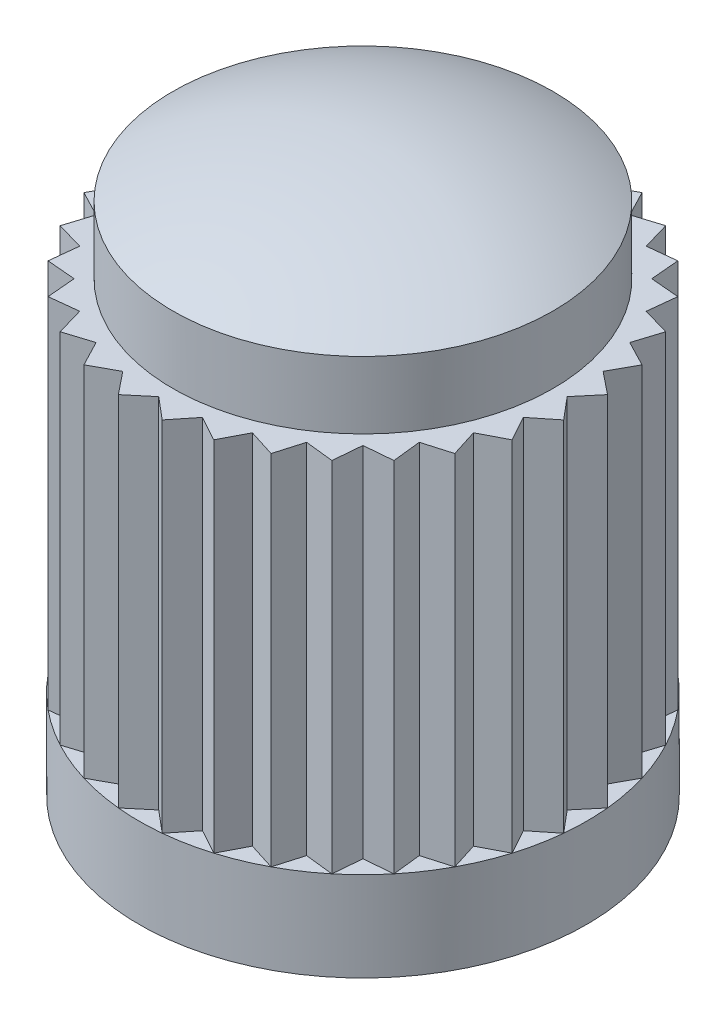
ISO-10303-21;
HEADER;
FILE_DESCRIPTION(('STEP AP214'),'2;1');
FILE_NAME('part.step','',(''),(''),'','','');
FILE_SCHEMA(('AUTOMOTIVE_DESIGN { 1 0 10303 214 1 1 1 1 }'));
ENDSEC;
DATA;
#1=APPLICATION_CONTEXT('core data for automotive mechanical design processes');
#2=APPLICATION_PROTOCOL_DEFINITION('international standard','automotive_design',2000,#1);
#3=PRODUCT_CONTEXT('',#1,'mechanical');
#4=PRODUCT('Part','Part','',(#3));
#5=PRODUCT_RELATED_PRODUCT_CATEGORY('part','',(#4));
#6=PRODUCT_DEFINITION_FORMATION('','',#4);
#7=PRODUCT_DEFINITION_CONTEXT('part definition',#1,'design');
#8=PRODUCT_DEFINITION('design','',#6,#7);
#9=PRODUCT_DEFINITION_SHAPE('','',#8);
#10=(LENGTH_UNIT() NAMED_UNIT(*) SI_UNIT(.MILLI.,.METRE.));
#11=(NAMED_UNIT(*) PLANE_ANGLE_UNIT() SI_UNIT($,.RADIAN.));
#12=(NAMED_UNIT(*) SI_UNIT($,.STERADIAN.) SOLID_ANGLE_UNIT());
#13=UNCERTAINTY_MEASURE_WITH_UNIT(LENGTH_MEASURE(1.E-05),#10,'distance_accuracy_value','');
#14=(GEOMETRIC_REPRESENTATION_CONTEXT(3) GLOBAL_UNCERTAINTY_ASSIGNED_CONTEXT((#13)) GLOBAL_UNIT_ASSIGNED_CONTEXT((#10,
#11,#12)) REPRESENTATION_CONTEXT('',''));
#15=CARTESIAN_POINT('',(0.,0.,0.));
#16=DIRECTION('',(0.,0.,1.));
#17=DIRECTION('',(1.,0.,0.));
#18=AXIS2_PLACEMENT_3D('',#15,#16,#17);
#19=CARTESIAN_POINT('',(-5.,0.,0.));
#20=DIRECTION('',(0.,1.,0.));
#21=DIRECTION('',(0.,0.,1.));
#22=AXIS2_PLACEMENT_3D('',#19,#20,#21);
#23=PLANE('',#22);
#24=CARTESIAN_POINT('',(0.,0.,0.));
#25=DIRECTION('',(0.,-1.,0.));
#26=DIRECTION('',(0.,0.,-1.));
#27=AXIS2_PLACEMENT_3D('',#24,#25,#26);
#28=CIRCLE('',#27,4.);
#29=CARTESIAN_POINT('',(0.,0.,-4.));
#30=VERTEX_POINT('',#29);
#31=EDGE_CURVE('E42',#30,#30,#28,.T.);
#32=ORIENTED_EDGE('',*,*,#31,.F.);
#33=EDGE_LOOP('',(#32));
#34=FACE_BOUND('',#33,.T.);
#35=CARTESIAN_POINT('',(0.,0.,0.));
#36=DIRECTION('',(0.,-1.,0.));
#37=DIRECTION('',(0.,0.,-1.));
#38=AXIS2_PLACEMENT_3D('',#35,#36,#37);
#39=CIRCLE('',#38,5.);
#40=CARTESIAN_POINT('',(0.,0.,-5.));
#41=VERTEX_POINT('',#40);
#42=EDGE_CURVE('E480',#41,#41,#39,.T.);
#43=ORIENTED_EDGE('',*,*,#42,.T.);
#44=EDGE_LOOP('',(#43));
#45=FACE_BOUND('',#44,.T.);
#46=ADVANCED_FACE('F35',(#34,#45),#23,.F.);
#47=CARTESIAN_POINT('',(0.,0.,0.));
#48=DIRECTION('',(0.,-1.,0.));
#49=DIRECTION('',(0.,0.,-1.));
#50=AXIS2_PLACEMENT_3D('',#47,#48,#49);
#51=CYLINDRICAL_SURFACE('',#50,4.);
#52=CARTESIAN_POINT('',(0.,5.,0.));
#53=DIRECTION('',(0.,-1.,0.));
#54=DIRECTION('',(0.,0.,-1.));
#55=AXIS2_PLACEMENT_3D('',#52,#53,#54);
#56=CIRCLE('',#55,4.);
#57=CARTESIAN_POINT('',(0.,5.,-4.));
#58=VERTEX_POINT('',#57);
#59=EDGE_CURVE('E499',#58,#58,#56,.T.);
#60=ORIENTED_EDGE('',*,*,#59,.F.);
#61=EDGE_LOOP('',(#60));
#62=FACE_BOUND('',#61,.T.);
#63=ORIENTED_EDGE('',*,*,#31,.T.);
#64=EDGE_LOOP('',(#63));
#65=FACE_BOUND('',#64,.T.);
#66=ADVANCED_FACE('F504',(#62,#65),#51,.F.);
#67=CARTESIAN_POINT('',(-4.,5.,0.));
#68=DIRECTION('',(0.,1.,0.));
#69=DIRECTION('',(0.,0.,1.));
#70=AXIS2_PLACEMENT_3D('',#67,#68,#69);
#71=PLANE('',#70);
#72=CARTESIAN_POINT('',(0.,5.,0.));
#73=DIRECTION('',(0.,-1.,0.));
#74=DIRECTION('',(0.,0.,-1.));
#75=AXIS2_PLACEMENT_3D('',#72,#73,#74);
#76=CIRCLE('',#75,3.5);
#77=CARTESIAN_POINT('',(0.,5.,-3.5));
#78=VERTEX_POINT('',#77);
#79=EDGE_CURVE('E496',#78,#78,#76,.T.);
#80=ORIENTED_EDGE('',*,*,#79,.F.);
#81=EDGE_LOOP('',(#80));
#82=FACE_BOUND('',#81,.T.);
#83=ORIENTED_EDGE('',*,*,#59,.T.);
#84=EDGE_LOOP('',(#83));
#85=FACE_BOUND('',#84,.T.);
#86=ADVANCED_FACE('F543',(#82,#85),#71,.F.);
#87=CARTESIAN_POINT('',(0.,0.,0.));
#88=DIRECTION('',(0.,-1.,0.));
#89=DIRECTION('',(0.,0.,-1.));
#90=AXIS2_PLACEMENT_3D('',#87,#88,#89);
#91=CYLINDRICAL_SURFACE('',#90,3.5);
#92=CARTESIAN_POINT('',(0.,10.,0.));
#93=DIRECTION('',(0.,-1.,0.));
#94=DIRECTION('',(0.,0.,-1.));
#95=AXIS2_PLACEMENT_3D('',#92,#93,#94);
#96=CIRCLE('',#95,3.5);
#97=CARTESIAN_POINT('',(0.,10.,-3.5));
#98=VERTEX_POINT('',#97);
#99=EDGE_CURVE('E493',#98,#98,#96,.T.);
#100=ORIENTED_EDGE('',*,*,#99,.F.);
#101=EDGE_LOOP('',(#100));
#102=FACE_BOUND('',#101,.T.);
#103=ORIENTED_EDGE('',*,*,#79,.T.);
#104=EDGE_LOOP('',(#103));
#105=FACE_BOUND('',#104,.T.);
#106=ADVANCED_FACE('F539',(#102,#105),#91,.F.);
#107=CARTESIAN_POINT('',(-3.5,10.,0.));
#108=DIRECTION('',(0.,1.,0.));
#109=DIRECTION('',(0.,0.,1.));
#110=AXIS2_PLACEMENT_3D('',#107,#108,#109);
#111=PLANE('',#110);
#112=CARTESIAN_POINT('',(0.,10.,0.));
#113=DIRECTION('',(0.,-1.,0.));
#114=DIRECTION('',(0.,0.,-1.));
#115=AXIS2_PLACEMENT_3D('',#112,#113,#114);
#116=CIRCLE('',#115,2.);
#117=CARTESIAN_POINT('',(0.,10.,-2.));
#118=VERTEX_POINT('',#117);
#119=EDGE_CURVE('E490',#118,#118,#116,.T.);
#120=ORIENTED_EDGE('',*,*,#119,.F.);
#121=EDGE_LOOP('',(#120));
#122=FACE_BOUND('',#121,.T.);
#123=ORIENTED_EDGE('',*,*,#99,.T.);
#124=EDGE_LOOP('',(#123));
#125=FACE_BOUND('',#124,.T.);
#126=ADVANCED_FACE('F535',(#122,#125),#111,.F.);
#127=CARTESIAN_POINT('',(0.,3.83977272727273,0.));
#128=DIRECTION('',(0.,-1.,0.));
#129=DIRECTION('',(-1.,0.,0.));
#130=AXIS2_PLACEMENT_3D('',#127,#128,#129);
#131=SPHERICAL_SURFACE('',#130,6.47675845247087);
#132=ORIENTED_EDGE('',*,*,#119,.T.);
#133=EDGE_LOOP('',(#132));
#134=FACE_BOUND('',#133,.T.);
#135=ADVANCED_FACE('F531',(#134),#131,.F.);
#136=CARTESIAN_POINT('',(0.,3.83977272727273,0.));
#137=DIRECTION('',(0.,-1.,0.));
#138=DIRECTION('',(1.,0.,0.));
#139=AXIS2_PLACEMENT_3D('',#136,#137,#138);
#140=SPHERICAL_SURFACE('',#139,8.76022727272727);
#141=CARTESIAN_POINT('',(0.,11.5,0.));
#142=DIRECTION('',(0.,-1.,0.));
#143=DIRECTION('',(0.,0.,-1.));
#144=AXIS2_PLACEMENT_3D('',#141,#142,#143);
#145=CIRCLE('',#144,4.25);
#146=CARTESIAN_POINT('',(0.,11.5,-4.25));
#147=VERTEX_POINT('',#146);
#148=EDGE_CURVE('E487',#147,#147,#145,.T.);
#149=ORIENTED_EDGE('',*,*,#148,.F.);
#150=EDGE_LOOP('',(#149));
#151=FACE_BOUND('',#150,.T.);
#152=ADVANCED_FACE('F527',(#151),#140,.T.);
#153=CARTESIAN_POINT('',(0.,0.,0.));
#154=DIRECTION('',(0.,-1.,0.));
#155=DIRECTION('',(0.,0.,-1.));
#156=AXIS2_PLACEMENT_3D('',#153,#154,#155);
#157=CYLINDRICAL_SURFACE('',#156,4.25);
#158=CARTESIAN_POINT('',(0.,10.,0.));
#159=DIRECTION('',(0.,-1.,0.));
#160=DIRECTION('',(0.,0.,-1.));
#161=AXIS2_PLACEMENT_3D('',#158,#159,#160);
#162=CIRCLE('',#161,4.25);
#163=CARTESIAN_POINT('',(0.,10.,-4.25));
#164=VERTEX_POINT('',#163);
#165=EDGE_CURVE('E484',#164,#164,#162,.T.);
#166=ORIENTED_EDGE('',*,*,#165,.F.);
#167=EDGE_LOOP('',(#166));
#168=FACE_BOUND('',#167,.T.);
#169=ORIENTED_EDGE('',*,*,#148,.T.);
#170=EDGE_LOOP('',(#169));
#171=FACE_BOUND('',#170,.T.);
#172=ADVANCED_FACE('F519',(#168,#171),#157,.T.);
#173=CARTESIAN_POINT('',(-5.,10.,0.));
#174=DIRECTION('',(0.,-1.,0.));
#175=DIRECTION('',(0.,0.,-1.));
#176=AXIS2_PLACEMENT_3D('',#173,#174,#175);
#177=PLANE('',#176);
#178=DIRECTION('',(-0.643252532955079,0.,0.765654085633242));
#179=VECTOR('',#178,1.);
#180=CARTESIAN_POINT('',(4.97592363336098,10.,-0.490085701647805));
#181=LINE('',#180,#179);
#182=CARTESIAN_POINT('',(4.97592363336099,10.,-0.490085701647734));
#183=VERTEX_POINT('',#182);
#184=CARTESIAN_POINT('',(4.56418565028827,10.,0.));
#185=VERTEX_POINT('',#184);
#186=EDGE_CURVE('E474',#183,#185,#181,.T.);
#187=ORIENTED_EDGE('',*,*,#186,.F.);
#188=DIRECTION('',(0.78026431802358,0.,0.625449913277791));
#189=VECTOR('',#188,1.);
#190=CARTESIAN_POINT('',(4.47648610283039,10.,-0.890428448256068));
#191=LINE('',#190,#189);
#192=CARTESIAN_POINT('',(4.47648610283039,10.,-0.890428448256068));
#193=VERTEX_POINT('',#192);
#194=EDGE_CURVE('E444',#193,#183,#191,.T.);
#195=ORIENTED_EDGE('',*,*,#194,.F.);
#196=DIRECTION('',(-0.481520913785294,0.,0.876434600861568));
#197=VECTOR('',#196,1.);
#198=CARTESIAN_POINT('',(4.78470167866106,10.,-1.45142338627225));
#199=LINE('',#198,#197);
#200=CARTESIAN_POINT('',(4.78470167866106,10.,-1.45142338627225));
#201=VERTEX_POINT('',#200);
#202=EDGE_CURVE('E1538',#201,#193,#199,.T.);
#203=ORIENTED_EDGE('',*,*,#202,.F.);
#204=DIRECTION('',(0.887290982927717,0.,0.46121005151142));
#205=VECTOR('',#204,1.);
#206=CARTESIAN_POINT('',(4.21675770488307,10.,-1.74663823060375));
#207=LINE('',#206,#205);
#208=CARTESIAN_POINT('',(4.21675770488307,10.,-1.74663823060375));
#209=VERTEX_POINT('',#208);
#210=EDGE_CURVE('E1554',#209,#201,#207,.T.);
#211=ORIENTED_EDGE('',*,*,#210,.F.);
#212=DIRECTION('',(-0.301284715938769,0.,0.95353422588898));
#213=VECTOR('',#212,1.);
#214=CARTESIAN_POINT('',(4.40960632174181,10.,-2.35698368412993));
#215=LINE('',#214,#213);
#216=CARTESIAN_POINT('',(4.40960632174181,10.,-2.35698368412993));
#217=VERTEX_POINT('',#216);
#218=EDGE_CURVE('E1545',#217,#209,#215,.T.);
#219=ORIENTED_EDGE('',*,*,#218,.F.);
#220=DIRECTION('',(0.960219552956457,0.,0.27924614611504));
#221=VECTOR('',#220,1.);
#222=CARTESIAN_POINT('',(3.79498167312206,10.,-2.53572568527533));
#223=LINE('',#222,#221);
#224=CARTESIAN_POINT('',(3.79498167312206,10.,-2.53572568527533));
#225=VERTEX_POINT('',#224);
#226=EDGE_CURVE('E1570',#225,#217,#223,.T.);
#227=ORIENTED_EDGE('',*,*,#226,.F.);
#228=DIRECTION('',(-0.109470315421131,0.,0.993990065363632));
#229=VECTOR('',#228,1.);
#230=CARTESIAN_POINT('',(3.86505226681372,10.,-3.17196642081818));
#231=LINE('',#230,#229);
#232=CARTESIAN_POINT('',(3.86505226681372,10.,-3.17196642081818));
#233=VERTEX_POINT('',#232);
#234=EDGE_CURVE('E1565',#233,#225,#231,.T.);
#235=ORIENTED_EDGE('',*,*,#234,.F.);
#236=DIRECTION('',(0.996247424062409,0.,0.0865509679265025));
#237=VECTOR('',#236,1.);
#238=CARTESIAN_POINT('',(3.2273666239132,10.,-3.22736662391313));
#239=LINE('',#238,#237);
#240=CARTESIAN_POINT('',(3.2273666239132,10.,-3.22736662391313));
#241=VERTEX_POINT('',#240);
#242=EDGE_CURVE('E1589',#241,#233,#239,.T.);
#243=ORIENTED_EDGE('',*,*,#242,.F.);
#244=DIRECTION('',(0.0865509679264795,0.,0.996247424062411));
#245=VECTOR('',#244,1.);
#246=CARTESIAN_POINT('',(3.17196642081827,10.,-3.86505226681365));
#247=LINE('',#246,#245);
#248=CARTESIAN_POINT('',(3.17196642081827,10.,-3.86505226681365));
#249=VERTEX_POINT('',#248);
#250=EDGE_CURVE('E1583',#249,#241,#247,.T.);
#251=ORIENTED_EDGE('',*,*,#250,.F.);
#252=DIRECTION('',(0.993990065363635,0.,-0.109470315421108));
#253=VECTOR('',#252,1.);
#254=CARTESIAN_POINT('',(2.53572568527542,10.,-3.79498167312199));
#255=LINE('',#254,#253);
#256=CARTESIAN_POINT('',(2.53572568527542,10.,-3.79498167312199));
#257=VERTEX_POINT('',#256);
#258=EDGE_CURVE('E1608',#257,#249,#255,.T.);
#259=ORIENTED_EDGE('',*,*,#258,.F.);
#260=DIRECTION('',(0.279246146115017,0.,0.960219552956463));
#261=VECTOR('',#260,1.);
#262=CARTESIAN_POINT('',(2.35698368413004,10.,-4.40960632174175));
#263=LINE('',#262,#261);
#264=CARTESIAN_POINT('',(2.35698368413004,10.,-4.40960632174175));
#265=VERTEX_POINT('',#264);
#266=EDGE_CURVE('E1602',#265,#257,#263,.T.);
#267=ORIENTED_EDGE('',*,*,#266,.F.);
#268=DIRECTION('',(0.953534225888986,0.,-0.301284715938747));
#269=VECTOR('',#268,1.);
#270=CARTESIAN_POINT('',(1.74663823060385,10.,-4.21675770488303));
#271=LINE('',#270,#269);
#272=CARTESIAN_POINT('',(1.74663823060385,10.,-4.21675770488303));
#273=VERTEX_POINT('',#272);
#274=EDGE_CURVE('E1627',#273,#265,#271,.T.);
#275=ORIENTED_EDGE('',*,*,#274,.F.);
#276=DIRECTION('',(0.461210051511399,0.,0.887290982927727));
#277=VECTOR('',#276,1.);
#278=CARTESIAN_POINT('',(1.45142338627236,10.,-4.78470167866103));
#279=LINE('',#278,#277);
#280=CARTESIAN_POINT('',(1.45142338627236,10.,-4.78470167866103));
#281=VERTEX_POINT('',#280);
#282=EDGE_CURVE('E1621',#281,#273,#279,.T.);
#283=ORIENTED_EDGE('',*,*,#282,.F.);
#284=DIRECTION('',(0.876434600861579,0.,-0.481520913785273));
#285=VECTOR('',#284,1.);
#286=CARTESIAN_POINT('',(0.890428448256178,10.,-4.47648610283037));
#287=LINE('',#286,#285);
#288=CARTESIAN_POINT('',(0.890428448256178,10.,-4.47648610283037));
#289=VERTEX_POINT('',#288);
#290=EDGE_CURVE('E1646',#289,#281,#287,.T.);
#291=ORIENTED_EDGE('',*,*,#290,.F.);
#292=DIRECTION('',(0.625449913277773,0.,0.780264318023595));
#293=VECTOR('',#292,1.);
#294=CARTESIAN_POINT('',(0.490085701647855,10.,-4.97592363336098));
#295=LINE('',#294,#293);
#296=CARTESIAN_POINT('',(0.490085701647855,10.,-4.97592363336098));
#297=VERTEX_POINT('',#296);
#298=EDGE_CURVE('E1640',#297,#289,#295,.T.);
#299=ORIENTED_EDGE('',*,*,#298,.F.);
#300=DIRECTION('',(0.765654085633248,0.,-0.643252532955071));
#301=VECTOR('',#300,1.);
#302=CARTESIAN_POINT('',(0.,10.,-4.56418565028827));
#303=LINE('',#302,#301);
#304=CARTESIAN_POINT('',(0.,10.,-4.56418565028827));
#305=VERTEX_POINT('',#304);
#306=EDGE_CURVE('E1665',#305,#297,#303,.T.);
#307=ORIENTED_EDGE('',*,*,#306,.F.);
#308=DIRECTION('',(0.765654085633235,0.,0.643252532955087));
#309=VECTOR('',#308,1.);
#310=CARTESIAN_POINT('',(-0.490085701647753,10.,-4.97592363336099));
#311=LINE('',#310,#309);
#312=CARTESIAN_POINT('',(-0.490085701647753,10.,-4.97592363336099));
#313=VERTEX_POINT('',#312);
#314=EDGE_CURVE('E1659',#313,#305,#311,.T.);
#315=ORIENTED_EDGE('',*,*,#314,.F.);
#316=DIRECTION('',(0.625449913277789,0.,-0.780264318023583));
#317=VECTOR('',#316,1.);
#318=CARTESIAN_POINT('',(-0.890428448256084,10.,-4.47648610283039));
#319=LINE('',#318,#317);
#320=CARTESIAN_POINT('',(-0.890428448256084,10.,-4.47648610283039));
#321=VERTEX_POINT('',#320);
#322=EDGE_CURVE('E1684',#321,#313,#319,.T.);
#323=ORIENTED_EDGE('',*,*,#322,.F.);
#324=DIRECTION('',(0.87643460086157,0.,0.481520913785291));
#325=VECTOR('',#324,1.);
#326=CARTESIAN_POINT('',(-1.45142338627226,10.,-4.78470167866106));
#327=LINE('',#326,#325);
#328=CARTESIAN_POINT('',(-1.45142338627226,10.,-4.78470167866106));
#329=VERTEX_POINT('',#328);
#330=EDGE_CURVE('E1678',#329,#321,#327,.T.);
#331=ORIENTED_EDGE('',*,*,#330,.F.);
#332=DIRECTION('',(0.461210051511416,0.,-0.887290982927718));
#333=VECTOR('',#332,1.);
#334=CARTESIAN_POINT('',(-1.74663823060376,10.,-4.21675770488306));
#335=LINE('',#334,#333);
#336=CARTESIAN_POINT('',(-1.74663823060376,10.,-4.21675770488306));
#337=VERTEX_POINT('',#336);
#338=EDGE_CURVE('E1703',#337,#329,#335,.T.);
#339=ORIENTED_EDGE('',*,*,#338,.F.);
#340=DIRECTION('',(0.953534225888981,0.,0.301284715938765));
#341=VECTOR('',#340,1.);
#342=CARTESIAN_POINT('',(-2.35698368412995,10.,-4.4096063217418));
#343=LINE('',#342,#341);
#344=CARTESIAN_POINT('',(-2.35698368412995,10.,-4.4096063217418));
#345=VERTEX_POINT('',#344);
#346=EDGE_CURVE('E1697',#345,#337,#343,.T.);
#347=ORIENTED_EDGE('',*,*,#346,.F.);
#348=DIRECTION('',(0.279246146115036,0.,-0.960219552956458));
#349=VECTOR('',#348,1.);
#350=CARTESIAN_POINT('',(-2.53572568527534,10.,-3.79498167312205));
#351=LINE('',#350,#349);
#352=CARTESIAN_POINT('',(-2.53572568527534,10.,-3.79498167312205));
#353=VERTEX_POINT('',#352);
#354=EDGE_CURVE('E1722',#353,#345,#351,.T.);
#355=ORIENTED_EDGE('',*,*,#354,.F.);
#356=DIRECTION('',(0.993990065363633,0.,0.109470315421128));
#357=VECTOR('',#356,1.);
#358=CARTESIAN_POINT('',(-3.17196642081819,10.,-3.86505226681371));
#359=LINE('',#358,#357);
#360=CARTESIAN_POINT('',(-3.17196642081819,10.,-3.86505226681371));
#361=VERTEX_POINT('',#360);
#362=EDGE_CURVE('E1716',#361,#353,#359,.T.);
#363=ORIENTED_EDGE('',*,*,#362,.F.);
#364=DIRECTION('',(0.086550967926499,0.,-0.996247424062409));
#365=VECTOR('',#364,1.);
#366=CARTESIAN_POINT('',(-3.22736662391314,10.,-3.22736662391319));
#367=LINE('',#366,#365);
#368=CARTESIAN_POINT('',(-3.22736662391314,10.,-3.22736662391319));
#369=VERTEX_POINT('',#368);
#370=EDGE_CURVE('E1741',#369,#361,#367,.T.);
#371=ORIENTED_EDGE('',*,*,#370,.F.);
#372=DIRECTION('',(0.996247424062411,0.,-0.0865509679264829));
#373=VECTOR('',#372,1.);
#374=CARTESIAN_POINT('',(-3.86505226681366,10.,-3.17196642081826));
#375=LINE('',#374,#373);
#376=CARTESIAN_POINT('',(-3.86505226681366,10.,-3.17196642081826));
#377=VERTEX_POINT('',#376);
#378=EDGE_CURVE('E1735',#377,#369,#375,.T.);
#379=ORIENTED_EDGE('',*,*,#378,.F.);
#380=DIRECTION('',(-0.109470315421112,0.,-0.993990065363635));
#381=VECTOR('',#380,1.);
#382=CARTESIAN_POINT('',(-3.794981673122,10.,-2.53572568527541));
#383=LINE('',#382,#381);
#384=CARTESIAN_POINT('',(-3.794981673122,10.,-2.53572568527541));
#385=VERTEX_POINT('',#384);
#386=EDGE_CURVE('E1760',#385,#377,#383,.T.);
#387=ORIENTED_EDGE('',*,*,#386,.F.);
#388=DIRECTION('',(0.960219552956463,0.,-0.279246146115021));
#389=VECTOR('',#388,1.);
#390=CARTESIAN_POINT('',(-4.40960632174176,10.,-2.35698368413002));
#391=LINE('',#390,#389);
#392=CARTESIAN_POINT('',(-4.40960632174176,10.,-2.35698368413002));
#393=VERTEX_POINT('',#392);
#394=EDGE_CURVE('E1754',#393,#385,#391,.T.);
#395=ORIENTED_EDGE('',*,*,#394,.F.);
#396=DIRECTION('',(-0.301284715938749,0.,-0.953534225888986));
#397=VECTOR('',#396,1.);
#398=CARTESIAN_POINT('',(-4.21675770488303,10.,-1.74663823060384));
#399=LINE('',#398,#397);
#400=CARTESIAN_POINT('',(-4.21675770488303,10.,-1.74663823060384));
#401=VERTEX_POINT('',#400);
#402=EDGE_CURVE('E1779',#401,#393,#399,.T.);
#403=ORIENTED_EDGE('',*,*,#402,.F.);
#404=DIRECTION('',(0.887290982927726,0.,-0.461210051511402));
#405=VECTOR('',#404,1.);
#406=CARTESIAN_POINT('',(-4.78470167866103,10.,-1.45142338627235));
#407=LINE('',#406,#405);
#408=CARTESIAN_POINT('',(-4.78470167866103,10.,-1.45142338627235));
#409=VERTEX_POINT('',#408);
#410=EDGE_CURVE('E1773',#409,#401,#407,.T.);
#411=ORIENTED_EDGE('',*,*,#410,.F.);
#412=DIRECTION('',(-0.481520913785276,0.,-0.876434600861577));
#413=VECTOR('',#412,1.);
#414=CARTESIAN_POINT('',(-4.47648610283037,10.,-0.890428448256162));
#415=LINE('',#414,#413);
#416=CARTESIAN_POINT('',(-4.47648610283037,10.,-0.890428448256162));
#417=VERTEX_POINT('',#416);
#418=EDGE_CURVE('E1798',#417,#409,#415,.T.);
#419=ORIENTED_EDGE('',*,*,#418,.F.);
#420=DIRECTION('',(0.780264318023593,0.,-0.625449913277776));
#421=VECTOR('',#420,1.);
#422=CARTESIAN_POINT('',(-4.97592363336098,10.,-0.490085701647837));
#423=LINE('',#422,#421);
#424=CARTESIAN_POINT('',(-4.97592363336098,10.,-0.490085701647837));
#425=VERTEX_POINT('',#424);
#426=EDGE_CURVE('E1792',#425,#417,#423,.T.);
#427=ORIENTED_EDGE('',*,*,#426,.F.);
#428=DIRECTION('',(-0.643252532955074,0.,-0.765654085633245));
#429=VECTOR('',#428,1.);
#430=CARTESIAN_POINT('',(-4.56418565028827,10.,0.));
#431=LINE('',#430,#429);
#432=CARTESIAN_POINT('',(-4.56418565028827,10.,0.));
#433=VERTEX_POINT('',#432);
#434=EDGE_CURVE('E1817',#433,#425,#431,.T.);
#435=ORIENTED_EDGE('',*,*,#434,.F.);
#436=DIRECTION('',(0.643252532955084,0.,-0.765654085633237));
#437=VECTOR('',#436,1.);
#438=CARTESIAN_POINT('',(-4.97592363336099,10.,0.49008570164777));
#439=LINE('',#438,#437);
#440=CARTESIAN_POINT('',(-4.97592363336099,10.,0.49008570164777));
#441=VERTEX_POINT('',#440);
#442=EDGE_CURVE('E1811',#441,#433,#439,.T.);
#443=ORIENTED_EDGE('',*,*,#442,.F.);
#444=DIRECTION('',(-0.780264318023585,0.,-0.625449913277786));
#445=VECTOR('',#444,1.);
#446=CARTESIAN_POINT('',(-4.47648610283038,10.,0.890428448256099));
#447=LINE('',#446,#445);
#448=CARTESIAN_POINT('',(-4.47648610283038,10.,0.890428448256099));
#449=VERTEX_POINT('',#448);
#450=EDGE_CURVE('E1836',#449,#441,#447,.T.);
#451=ORIENTED_EDGE('',*,*,#450,.F.);
#452=DIRECTION('',(0.481520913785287,0.,-0.876434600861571));
#453=VECTOR('',#452,1.);
#454=CARTESIAN_POINT('',(-4.78470167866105,10.,1.45142338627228));
#455=LINE('',#454,#453);
#456=CARTESIAN_POINT('',(-4.78470167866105,10.,1.45142338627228));
#457=VERTEX_POINT('',#456);
#458=EDGE_CURVE('E1830',#457,#449,#455,.T.);
#459=ORIENTED_EDGE('',*,*,#458,.F.);
#460=DIRECTION('',(-0.88729098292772,0.,-0.461210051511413));
#461=VECTOR('',#460,1.);
#462=CARTESIAN_POINT('',(-4.21675770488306,10.,1.74663823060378));
#463=LINE('',#462,#461);
#464=CARTESIAN_POINT('',(-4.21675770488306,10.,1.74663823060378));
#465=VERTEX_POINT('',#464);
#466=EDGE_CURVE('E1855',#465,#457,#463,.T.);
#467=ORIENTED_EDGE('',*,*,#466,.F.);
#468=DIRECTION('',(0.301284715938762,0.,-0.953534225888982));
#469=VECTOR('',#468,1.);
#470=CARTESIAN_POINT('',(-4.40960632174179,10.,2.35698368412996));
#471=LINE('',#470,#469);
#472=CARTESIAN_POINT('',(-4.40960632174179,10.,2.35698368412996));
#473=VERTEX_POINT('',#472);
#474=EDGE_CURVE('E1849',#473,#465,#471,.T.);
#475=ORIENTED_EDGE('',*,*,#474,.F.);
#476=DIRECTION('',(-0.960219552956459,0.,-0.279246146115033));
#477=VECTOR('',#476,1.);
#478=CARTESIAN_POINT('',(-3.79498167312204,10.,2.53572568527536));
#479=LINE('',#478,#477);
#480=CARTESIAN_POINT('',(-3.79498167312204,10.,2.53572568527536));
#481=VERTEX_POINT('',#480);
#482=EDGE_CURVE('E1874',#481,#473,#479,.T.);
#483=ORIENTED_EDGE('',*,*,#482,.F.);
#484=DIRECTION('',(0.109470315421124,0.,-0.993990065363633));
#485=VECTOR('',#484,1.);
#486=CARTESIAN_POINT('',(-3.8650522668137,10.,3.17196642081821));
#487=LINE('',#486,#485);
#488=CARTESIAN_POINT('',(-3.8650522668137,10.,3.17196642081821));
#489=VERTEX_POINT('',#488);
#490=EDGE_CURVE('E1868',#489,#481,#487,.T.);
#491=ORIENTED_EDGE('',*,*,#490,.F.);
#492=DIRECTION('',(-0.99624742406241,0.,-0.0865509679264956));
#493=VECTOR('',#492,1.);
#494=CARTESIAN_POINT('',(-3.22736662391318,10.,3.22736662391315));
#495=LINE('',#494,#493);
#496=CARTESIAN_POINT('',(-3.22736662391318,10.,3.22736662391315));
#497=VERTEX_POINT('',#496);
#498=EDGE_CURVE('E1893',#497,#489,#495,.T.);
#499=ORIENTED_EDGE('',*,*,#498,.F.);
#500=DIRECTION('',(-0.0865509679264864,0.,-0.99624742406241));
#501=VECTOR('',#500,1.);
#502=CARTESIAN_POINT('',(-3.17196642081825,10.,3.86505226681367));
#503=LINE('',#502,#501);
#504=CARTESIAN_POINT('',(-3.17196642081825,10.,3.86505226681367));
#505=VERTEX_POINT('',#504);
#506=EDGE_CURVE('E1887',#505,#497,#503,.T.);
#507=ORIENTED_EDGE('',*,*,#506,.F.);
#508=DIRECTION('',(-0.993990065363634,0.,0.109470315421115));
#509=VECTOR('',#508,1.);
#510=CARTESIAN_POINT('',(-2.5357256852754,10.,3.79498167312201));
#511=LINE('',#510,#509);
#512=CARTESIAN_POINT('',(-2.5357256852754,10.,3.79498167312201));
#513=VERTEX_POINT('',#512);
#514=EDGE_CURVE('E1912',#513,#505,#511,.T.);
#515=ORIENTED_EDGE('',*,*,#514,.F.);
#516=DIRECTION('',(-0.279246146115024,0.,-0.960219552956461));
#517=VECTOR('',#516,1.);
#518=CARTESIAN_POINT('',(-2.35698368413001,10.,4.40960632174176));
#519=LINE('',#518,#517);
#520=CARTESIAN_POINT('',(-2.35698368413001,10.,4.40960632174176));
#521=VERTEX_POINT('',#520);
#522=EDGE_CURVE('E1906',#521,#513,#519,.T.);
#523=ORIENTED_EDGE('',*,*,#522,.F.);
#524=DIRECTION('',(-0.953534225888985,0.,0.301284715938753));
#525=VECTOR('',#524,1.);
#526=CARTESIAN_POINT('',(-1.74663823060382,10.,4.21675770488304));
#527=LINE('',#526,#525);
#528=CARTESIAN_POINT('',(-1.74663823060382,10.,4.21675770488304));
#529=VERTEX_POINT('',#528);
#530=EDGE_CURVE('E1931',#529,#521,#527,.T.);
#531=ORIENTED_EDGE('',*,*,#530,.F.);
#532=DIRECTION('',(-0.461210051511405,0.,-0.887290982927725));
#533=VECTOR('',#532,1.);
#534=CARTESIAN_POINT('',(-1.45142338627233,10.,4.78470167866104));
#535=LINE('',#534,#533);
#536=CARTESIAN_POINT('',(-1.45142338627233,10.,4.78470167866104));
#537=VERTEX_POINT('',#536);
#538=EDGE_CURVE('E1925',#537,#529,#535,.T.);
#539=ORIENTED_EDGE('',*,*,#538,.F.);
#540=DIRECTION('',(-0.876434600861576,0.,0.481520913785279));
#541=VECTOR('',#540,1.);
#542=CARTESIAN_POINT('',(-0.890428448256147,10.,4.47648610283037));
#543=LINE('',#542,#541);
#544=CARTESIAN_POINT('',(-0.890428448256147,10.,4.47648610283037));
#545=VERTEX_POINT('',#544);
#546=EDGE_CURVE('E1950',#545,#537,#543,.T.);
#547=ORIENTED_EDGE('',*,*,#546,.F.);
#548=DIRECTION('',(-0.625449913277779,0.,-0.780264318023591));
#549=VECTOR('',#548,1.);
#550=CARTESIAN_POINT('',(-0.490085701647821,10.,4.97592363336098));
#551=LINE('',#550,#549);
#552=CARTESIAN_POINT('',(-0.490085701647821,10.,4.97592363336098));
#553=VERTEX_POINT('',#552);
#554=EDGE_CURVE('E1944',#553,#545,#551,.T.);
#555=ORIENTED_EDGE('',*,*,#554,.F.);
#556=DIRECTION('',(-0.765654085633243,0.,0.643252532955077));
#557=VECTOR('',#556,1.);
#558=CARTESIAN_POINT('',(0.,10.,4.56418565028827));
#559=LINE('',#558,#557);
#560=CARTESIAN_POINT('',(0.,10.,4.56418565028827));
#561=VERTEX_POINT('',#560);
#562=EDGE_CURVE('E1969',#561,#553,#559,.T.);
#563=ORIENTED_EDGE('',*,*,#562,.F.);
#564=DIRECTION('',(-0.76565408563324,0.,-0.643252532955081));
#565=VECTOR('',#564,1.);
#566=CARTESIAN_POINT('',(0.490085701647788,10.,4.97592363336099));
#567=LINE('',#566,#565);
#568=CARTESIAN_POINT('',(0.490085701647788,10.,4.97592363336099));
#569=VERTEX_POINT('',#568);
#570=EDGE_CURVE('E1963',#569,#561,#567,.T.);
#571=ORIENTED_EDGE('',*,*,#570,.F.);
#572=DIRECTION('',(-0.625449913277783,0.,0.780264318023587));
#573=VECTOR('',#572,1.);
#574=CARTESIAN_POINT('',(0.890428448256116,10.,4.47648610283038));
#575=LINE('',#574,#573);
#576=CARTESIAN_POINT('',(0.890428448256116,10.,4.47648610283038));
#577=VERTEX_POINT('',#576);
#578=EDGE_CURVE('E1988',#577,#569,#575,.T.);
#579=ORIENTED_EDGE('',*,*,#578,.F.);
#580=DIRECTION('',(-0.876434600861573,0.,-0.481520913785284));
#581=VECTOR('',#580,1.);
#582=CARTESIAN_POINT('',(1.4514233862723,10.,4.78470167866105));
#583=LINE('',#582,#581);
#584=CARTESIAN_POINT('',(1.4514233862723,10.,4.78470167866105));
#585=VERTEX_POINT('',#584);
#586=EDGE_CURVE('E1982',#585,#577,#583,.T.);
#587=ORIENTED_EDGE('',*,*,#586,.F.);
#588=DIRECTION('',(-0.46121005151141,0.,0.887290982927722));
#589=VECTOR('',#588,1.);
#590=CARTESIAN_POINT('',(1.74663823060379,10.,4.21675770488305));
#591=LINE('',#590,#589);
#592=CARTESIAN_POINT('',(1.74663823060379,10.,4.21675770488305));
#593=VERTEX_POINT('',#592);
#594=EDGE_CURVE('E2007',#593,#585,#591,.T.);
#595=ORIENTED_EDGE('',*,*,#594,.F.);
#596=DIRECTION('',(-0.953534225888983,0.,-0.301284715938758));
#597=VECTOR('',#596,1.);
#598=CARTESIAN_POINT('',(2.35698368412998,10.,4.40960632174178));
#599=LINE('',#598,#597);
#600=CARTESIAN_POINT('',(2.35698368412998,10.,4.40960632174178));
#601=VERTEX_POINT('',#600);
#602=EDGE_CURVE('E2001',#601,#593,#599,.T.);
#603=ORIENTED_EDGE('',*,*,#602,.F.);
#604=DIRECTION('',(-0.27924614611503,0.,0.96021955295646));
#605=VECTOR('',#604,1.);
#606=CARTESIAN_POINT('',(2.53572568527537,10.,3.79498167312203));
#607=LINE('',#606,#605);
#608=CARTESIAN_POINT('',(2.53572568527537,10.,3.79498167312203));
#609=VERTEX_POINT('',#608);
#610=EDGE_CURVE('E2026',#609,#601,#607,.T.);
#611=ORIENTED_EDGE('',*,*,#610,.F.);
#612=DIRECTION('',(-0.993990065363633,0.,-0.109470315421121));
#613=VECTOR('',#612,1.);
#614=CARTESIAN_POINT('',(3.17196642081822,10.,3.86505226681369));
#615=LINE('',#614,#613);
#616=CARTESIAN_POINT('',(3.17196642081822,10.,3.86505226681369));
#617=VERTEX_POINT('',#616);
#618=EDGE_CURVE('E2020',#617,#609,#615,.T.);
#619=ORIENTED_EDGE('',*,*,#618,.F.);
#620=DIRECTION('',(-0.0865509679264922,0.,0.99624742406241));
#621=VECTOR('',#620,1.);
#622=CARTESIAN_POINT('',(3.22736662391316,10.,3.22736662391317));
#623=LINE('',#622,#621);
#624=CARTESIAN_POINT('',(3.22736662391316,10.,3.22736662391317));
#625=VERTEX_POINT('',#624);
#626=EDGE_CURVE('E2045',#625,#617,#623,.T.);
#627=ORIENTED_EDGE('',*,*,#626,.F.);
#628=DIRECTION('',(-0.99624742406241,0.,0.0865509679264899));
#629=VECTOR('',#628,1.);
#630=CARTESIAN_POINT('',(3.86505226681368,10.,3.17196642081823));
#631=LINE('',#630,#629);
#632=CARTESIAN_POINT('',(3.86505226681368,10.,3.17196642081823));
#633=VERTEX_POINT('',#632);
#634=EDGE_CURVE('E2039',#633,#625,#631,.T.);
#635=ORIENTED_EDGE('',*,*,#634,.F.);
#636=DIRECTION('',(0.109470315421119,0.,0.993990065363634));
#637=VECTOR('',#636,1.);
#638=CARTESIAN_POINT('',(3.79498167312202,10.,2.53572568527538));
#639=LINE('',#638,#637);
#640=CARTESIAN_POINT('',(3.79498167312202,10.,2.53572568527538));
#641=VERTEX_POINT('',#640);
#642=EDGE_CURVE('E2064',#641,#633,#639,.T.);
#643=ORIENTED_EDGE('',*,*,#642,.F.);
#644=DIRECTION('',(-0.960219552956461,0.,0.279246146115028));
#645=VECTOR('',#644,1.);
#646=CARTESIAN_POINT('',(4.40960632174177,10.,2.35698368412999));
#647=LINE('',#646,#645);
#648=CARTESIAN_POINT('',(4.40960632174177,10.,2.35698368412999));
#649=VERTEX_POINT('',#648);
#650=EDGE_CURVE('E2058',#649,#641,#647,.T.);
#651=ORIENTED_EDGE('',*,*,#650,.F.);
#652=DIRECTION('',(0.301284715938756,0.,0.953534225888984));
#653=VECTOR('',#652,1.);
#654=CARTESIAN_POINT('',(4.21675770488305,10.,1.74663823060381));
#655=LINE('',#654,#653);
#656=CARTESIAN_POINT('',(4.21675770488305,10.,1.74663823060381));
#657=VERTEX_POINT('',#656);
#658=EDGE_CURVE('E2083',#657,#649,#655,.T.);
#659=ORIENTED_EDGE('',*,*,#658,.F.);
#660=DIRECTION('',(-0.887290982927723,0.,0.461210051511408));
#661=VECTOR('',#660,1.);
#662=CARTESIAN_POINT('',(4.78470167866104,10.,1.45142338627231));
#663=LINE('',#662,#661);
#664=CARTESIAN_POINT('',(4.78470167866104,10.,1.45142338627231));
#665=VERTEX_POINT('',#664);
#666=EDGE_CURVE('E2077',#665,#657,#663,.T.);
#667=ORIENTED_EDGE('',*,*,#666,.F.);
#668=DIRECTION('',(0.481520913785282,0.,0.876434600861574));
#669=VECTOR('',#668,1.);
#670=CARTESIAN_POINT('',(4.47648610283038,10.,0.890428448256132));
#671=LINE('',#670,#669);
#672=CARTESIAN_POINT('',(4.47648610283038,10.,0.890428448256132));
#673=VERTEX_POINT('',#672);
#674=EDGE_CURVE('E2104',#673,#665,#671,.T.);
#675=ORIENTED_EDGE('',*,*,#674,.F.);
#676=DIRECTION('',(-0.780264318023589,0.,0.625449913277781));
#677=VECTOR('',#676,1.);
#678=CARTESIAN_POINT('',(4.97592363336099,10.,0.490085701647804));
#679=LINE('',#678,#677);
#680=CARTESIAN_POINT('',(4.97592363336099,10.,0.490085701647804));
#681=VERTEX_POINT('',#680);
#682=EDGE_CURVE('E2096',#681,#673,#679,.T.);
#683=ORIENTED_EDGE('',*,*,#682,.F.);
#684=DIRECTION('',(0.643252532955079,0.,0.765654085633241));
#685=VECTOR('',#684,1.);
#686=CARTESIAN_POINT('',(4.56418565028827,10.,0.));
#687=LINE('',#686,#685);
#688=EDGE_CURVE('E470',#185,#681,#687,.T.);
#689=ORIENTED_EDGE('',*,*,#688,.F.);
#690=EDGE_LOOP('',(#187,#195,#203,#211,#219,#227,#235,#243,#251,#259,#267,#275,#283,#291,#299,
#307,#315,#323,#331,#339,#347,#355,#363,#371,#379,#387,#395,#403,#411,#419,#427,#435,#443,#451,
#459,#467,#475,#483,#491,#499,#507,#515,#523,#531,#539,#547,#555,#563,#571,#579,#587,#595,#603,
#611,#619,#627,#635,#643,#651,#659,#667,#675,#683,#689));
#691=FACE_BOUND('',#690,.T.);
#692=ORIENTED_EDGE('',*,*,#165,.T.);
#693=EDGE_LOOP('',(#692));
#694=FACE_BOUND('',#693,.T.);
#695=ADVANCED_FACE('F511',(#691,#694),#177,.F.);
#696=CARTESIAN_POINT('',(0.,0.,0.));
#697=DIRECTION('',(0.,-1.,0.));
#698=DIRECTION('',(0.,0.,-1.));
#699=AXIS2_PLACEMENT_3D('',#696,#697,#698);
#700=CYLINDRICAL_SURFACE('',#699,5.);
#701=ORIENTED_EDGE('',*,*,#42,.F.);
#702=EDGE_LOOP('',(#701));
#703=FACE_BOUND('',#702,.T.);
#704=CARTESIAN_POINT('',(0.,2.,0.));
#705=DIRECTION('',(0.,-1.,0.));
#706=DIRECTION('',(-0.382683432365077,0.,-0.923879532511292));
#707=AXIS2_PLACEMENT_3D('',#704,#705,#706);
#708=CIRCLE('',#707,5.);
#709=CARTESIAN_POINT('',(4.4096063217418,2.,-2.35698368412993));
#710=VERTEX_POINT('',#709);
#711=CARTESIAN_POINT('',(4.78470167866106,2.,-1.45142338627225));
#712=VERTEX_POINT('',#711);
#713=EDGE_CURVE('E461',#710,#712,#708,.T.);
#714=ORIENTED_EDGE('',*,*,#713,.T.);
#715=CARTESIAN_POINT('',(0.,2.,0.));
#716=DIRECTION('',(0.,-1.,0.));
#717=DIRECTION('',(-0.195090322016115,0.,-0.980785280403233));
#718=AXIS2_PLACEMENT_3D('',#715,#716,#717);
#719=CIRCLE('',#718,5.);
#720=CARTESIAN_POINT('',(4.97592363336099,2.,-0.490085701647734));
#721=VERTEX_POINT('',#720);
#722=EDGE_CURVE('E452',#712,#721,#719,.T.);
#723=ORIENTED_EDGE('',*,*,#722,.T.);
#724=CARTESIAN_POINT('',(0.,2.,0.));
#725=DIRECTION('',(0.,-1.,0.));
#726=DIRECTION('',(0.,0.,-1.));
#727=AXIS2_PLACEMENT_3D('',#724,#725,#726);
#728=CIRCLE('',#727,5.);
#729=CARTESIAN_POINT('',(4.97592363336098,2.,0.490085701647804));
#730=VERTEX_POINT('',#729);
#731=EDGE_CURVE('E11',#721,#730,#728,.T.);
#732=ORIENTED_EDGE('',*,*,#731,.T.);
#733=CARTESIAN_POINT('',(0.,2.,0.));
#734=DIRECTION('',(0.,-1.,0.));
#735=DIRECTION('',(0.195090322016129,0.,-0.980785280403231));
#736=AXIS2_PLACEMENT_3D('',#733,#734,#735);
#737=CIRCLE('',#736,5.);
#738=CARTESIAN_POINT('',(4.78470167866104,2.,1.45142338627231));
#739=VERTEX_POINT('',#738);
#740=EDGE_CURVE('E49',#730,#739,#737,.T.);
#741=ORIENTED_EDGE('',*,*,#740,.T.);
#742=CARTESIAN_POINT('',(0.,2.,0.));
#743=DIRECTION('',(0.,-1.,0.));
#744=DIRECTION('',(0.382683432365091,0.,-0.923879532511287));
#745=AXIS2_PLACEMENT_3D('',#742,#743,#744);
#746=CIRCLE('',#745,5.);
#747=CARTESIAN_POINT('',(4.40960632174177,2.,2.35698368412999));
#748=VERTEX_POINT('',#747);
#749=EDGE_CURVE('E2079',#739,#748,#746,.T.);
#750=ORIENTED_EDGE('',*,*,#749,.T.);
#751=CARTESIAN_POINT('',(0.,2.,0.));
#752=DIRECTION('',(0.,-1.,0.));
#753=DIRECTION('',(0.555570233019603,0.,-0.831469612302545));
#754=AXIS2_PLACEMENT_3D('',#751,#752,#753);
#755=CIRCLE('',#754,5.);
#756=CARTESIAN_POINT('',(3.86505226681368,2.,3.17196642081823));
#757=VERTEX_POINT('',#756);
#758=EDGE_CURVE('E2060',#748,#757,#755,.T.);
#759=ORIENTED_EDGE('',*,*,#758,.T.);
#760=CARTESIAN_POINT('',(0.,2.,0.));
#761=DIRECTION('',(0.,-1.,0.));
#762=DIRECTION('',(0.707106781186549,0.,-0.707106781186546));
#763=AXIS2_PLACEMENT_3D('',#760,#761,#762);
#764=CIRCLE('',#763,5.);
#765=CARTESIAN_POINT('',(3.17196642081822,2.,3.86505226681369));
#766=VERTEX_POINT('',#765);
#767=EDGE_CURVE('E2041',#757,#766,#764,.T.);
#768=ORIENTED_EDGE('',*,*,#767,.T.);
#769=CARTESIAN_POINT('',(0.,2.,0.));
#770=DIRECTION('',(0.,-1.,0.));
#771=DIRECTION('',(0.831469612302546,0.,-0.5555702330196));
#772=AXIS2_PLACEMENT_3D('',#769,#770,#771);
#773=CIRCLE('',#772,5.);
#774=CARTESIAN_POINT('',(2.35698368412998,2.,4.40960632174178));
#775=VERTEX_POINT('',#774);
#776=EDGE_CURVE('E2022',#766,#775,#773,.T.);
#777=ORIENTED_EDGE('',*,*,#776,.T.);
#778=CARTESIAN_POINT('',(0.,2.,0.));
#779=DIRECTION('',(0.,-1.,0.));
#780=DIRECTION('',(0.923879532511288,0.,-0.382683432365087));
#781=AXIS2_PLACEMENT_3D('',#778,#779,#780);
#782=CIRCLE('',#781,5.);
#783=CARTESIAN_POINT('',(1.4514233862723,2.,4.78470167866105));
#784=VERTEX_POINT('',#783);
#785=EDGE_CURVE('E2003',#775,#784,#782,.T.);
#786=ORIENTED_EDGE('',*,*,#785,.T.);
#787=CARTESIAN_POINT('',(0.,2.,0.));
#788=DIRECTION('',(0.,-1.,0.));
#789=DIRECTION('',(0.980785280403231,0.,-0.195090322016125));
#790=AXIS2_PLACEMENT_3D('',#787,#788,#789);
#791=CIRCLE('',#790,5.);
#792=CARTESIAN_POINT('',(0.490085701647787,2.,4.97592363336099));
#793=VERTEX_POINT('',#792);
#794=EDGE_CURVE('E1984',#784,#793,#791,.T.);
#795=ORIENTED_EDGE('',*,*,#794,.T.);
#796=CARTESIAN_POINT('',(0.,2.,0.));
#797=DIRECTION('',(0.,-1.,0.));
#798=DIRECTION('',(1.,0.,0.));
#799=AXIS2_PLACEMENT_3D('',#796,#797,#798);
#800=CIRCLE('',#799,5.);
#801=CARTESIAN_POINT('',(-0.490085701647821,2.,4.97592363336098));
#802=VERTEX_POINT('',#801);
#803=EDGE_CURVE('E1965',#793,#802,#800,.T.);
#804=ORIENTED_EDGE('',*,*,#803,.T.);
#805=CARTESIAN_POINT('',(0.,2.,0.));
#806=DIRECTION('',(0.,-1.,0.));
#807=DIRECTION('',(0.98078528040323,0.,0.195090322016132));
#808=AXIS2_PLACEMENT_3D('',#805,#806,#807);
#809=CIRCLE('',#808,5.);
#810=CARTESIAN_POINT('',(-1.45142338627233,2.,4.78470167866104));
#811=VERTEX_POINT('',#810);
#812=EDGE_CURVE('E1946',#802,#811,#809,.T.);
#813=ORIENTED_EDGE('',*,*,#812,.T.);
#814=CARTESIAN_POINT('',(0.,2.,0.));
#815=DIRECTION('',(0.,-1.,0.));
#816=DIRECTION('',(0.923879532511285,0.,0.382683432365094));
#817=AXIS2_PLACEMENT_3D('',#814,#815,#816);
#818=CIRCLE('',#817,5.);
#819=CARTESIAN_POINT('',(-2.35698368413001,2.,4.40960632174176));
#820=VERTEX_POINT('',#819);
#821=EDGE_CURVE('E1927',#811,#820,#818,.T.);
#822=ORIENTED_EDGE('',*,*,#821,.T.);
#823=CARTESIAN_POINT('',(0.,2.,0.));
#824=DIRECTION('',(0.,-1.,0.));
#825=DIRECTION('',(0.831469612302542,0.,0.555570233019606));
#826=AXIS2_PLACEMENT_3D('',#823,#824,#825);
#827=CIRCLE('',#826,5.);
#828=CARTESIAN_POINT('',(-3.17196642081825,2.,3.86505226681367));
#829=VERTEX_POINT('',#828);
#830=EDGE_CURVE('E1908',#820,#829,#827,.T.);
#831=ORIENTED_EDGE('',*,*,#830,.T.);
#832=CARTESIAN_POINT('',(0.,2.,0.));
#833=DIRECTION('',(0.,-1.,0.));
#834=DIRECTION('',(0.707106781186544,0.,0.707106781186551));
#835=AXIS2_PLACEMENT_3D('',#832,#833,#834);
#836=CIRCLE('',#835,5.);
#837=CARTESIAN_POINT('',(-3.8650522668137,2.,3.17196642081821));
#838=VERTEX_POINT('',#837);
#839=EDGE_CURVE('E1889',#829,#838,#836,.T.);
#840=ORIENTED_EDGE('',*,*,#839,.T.);
#841=CARTESIAN_POINT('',(0.,2.,0.));
#842=DIRECTION('',(0.,-1.,0.));
#843=DIRECTION('',(0.555570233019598,0.,0.831469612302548));
#844=AXIS2_PLACEMENT_3D('',#841,#842,#843);
#845=CIRCLE('',#844,5.);
#846=CARTESIAN_POINT('',(-4.40960632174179,2.,2.35698368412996));
#847=VERTEX_POINT('',#846);
#848=EDGE_CURVE('E1870',#838,#847,#845,.T.);
#849=ORIENTED_EDGE('',*,*,#848,.T.);
#850=CARTESIAN_POINT('',(0.,2.,0.));
#851=DIRECTION('',(0.,-1.,0.));
#852=DIRECTION('',(0.382683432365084,0.,0.923879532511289));
#853=AXIS2_PLACEMENT_3D('',#850,#851,#852);
#854=CIRCLE('',#853,5.);
#855=CARTESIAN_POINT('',(-4.78470167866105,2.,1.45142338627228));
#856=VERTEX_POINT('',#855);
#857=EDGE_CURVE('E1851',#847,#856,#854,.T.);
#858=ORIENTED_EDGE('',*,*,#857,.T.);
#859=CARTESIAN_POINT('',(0.,2.,0.));
#860=DIRECTION('',(0.,-1.,0.));
#861=DIRECTION('',(0.195090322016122,0.,0.980785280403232));
#862=AXIS2_PLACEMENT_3D('',#859,#860,#861);
#863=CIRCLE('',#862,5.);
#864=CARTESIAN_POINT('',(-4.97592363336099,2.,0.490085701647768));
#865=VERTEX_POINT('',#864);
#866=EDGE_CURVE('E1832',#856,#865,#863,.T.);
#867=ORIENTED_EDGE('',*,*,#866,.T.);
#868=CARTESIAN_POINT('',(0.,2.,0.));
#869=DIRECTION('',(0.,-1.,0.));
#870=DIRECTION('',(0.,0.,1.));
#871=AXIS2_PLACEMENT_3D('',#868,#869,#870);
#872=CIRCLE('',#871,5.);
#873=CARTESIAN_POINT('',(-4.97592363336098,2.,-0.490085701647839));
#874=VERTEX_POINT('',#873);
#875=EDGE_CURVE('E1813',#865,#874,#872,.T.);
#876=ORIENTED_EDGE('',*,*,#875,.T.);
#877=CARTESIAN_POINT('',(0.,2.,0.));
#878=DIRECTION('',(0.,-1.,0.));
#879=DIRECTION('',(-0.195090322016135,0.,0.980785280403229));
#880=AXIS2_PLACEMENT_3D('',#877,#878,#879);
#881=CIRCLE('',#880,5.);
#882=CARTESIAN_POINT('',(-4.78470167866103,2.,-1.45142338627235));
#883=VERTEX_POINT('',#882);
#884=EDGE_CURVE('E1794',#874,#883,#881,.T.);
#885=ORIENTED_EDGE('',*,*,#884,.T.);
#886=CARTESIAN_POINT('',(0.,2.,0.));
#887=DIRECTION('',(0.,-1.,0.));
#888=DIRECTION('',(-0.382683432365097,0.,0.923879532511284));
#889=AXIS2_PLACEMENT_3D('',#886,#887,#888);
#890=CIRCLE('',#889,5.);
#891=CARTESIAN_POINT('',(-4.40960632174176,2.,-2.35698368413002));
#892=VERTEX_POINT('',#891);
#893=EDGE_CURVE('E1775',#883,#892,#890,.T.);
#894=ORIENTED_EDGE('',*,*,#893,.T.);
#895=CARTESIAN_POINT('',(0.,2.,0.));
#896=DIRECTION('',(0.,-1.,0.));
#897=DIRECTION('',(-0.555570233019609,0.,0.831469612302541));
#898=AXIS2_PLACEMENT_3D('',#895,#896,#897);
#899=CIRCLE('',#898,5.);
#900=CARTESIAN_POINT('',(-3.86505226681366,2.,-3.17196642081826));
#901=VERTEX_POINT('',#900);
#902=EDGE_CURVE('E1756',#892,#901,#899,.T.);
#903=ORIENTED_EDGE('',*,*,#902,.T.);
#904=CARTESIAN_POINT('',(0.,2.,0.));
#905=DIRECTION('',(0.,-1.,0.));
#906=DIRECTION('',(-0.707106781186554,0.,0.707106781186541));
#907=AXIS2_PLACEMENT_3D('',#904,#905,#906);
#908=CIRCLE('',#907,5.);
#909=CARTESIAN_POINT('',(-3.17196642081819,2.,-3.86505226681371));
#910=VERTEX_POINT('',#909);
#911=EDGE_CURVE('E1737',#901,#910,#908,.T.);
#912=ORIENTED_EDGE('',*,*,#911,.T.);
#913=CARTESIAN_POINT('',(0.,2.,0.));
#914=DIRECTION('',(0.,-1.,0.));
#915=DIRECTION('',(-0.83146961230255,0.,0.555570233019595));
#916=AXIS2_PLACEMENT_3D('',#913,#914,#915);
#917=CIRCLE('',#916,5.);
#918=CARTESIAN_POINT('',(-2.35698368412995,2.,-4.4096063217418));
#919=VERTEX_POINT('',#918);
#920=EDGE_CURVE('E1718',#910,#919,#917,.T.);
#921=ORIENTED_EDGE('',*,*,#920,.T.);
#922=CARTESIAN_POINT('',(0.,2.,0.));
#923=DIRECTION('',(0.,-1.,0.));
#924=DIRECTION('',(-0.923879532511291,0.,0.382683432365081));
#925=AXIS2_PLACEMENT_3D('',#922,#923,#924);
#926=CIRCLE('',#925,5.);
#927=CARTESIAN_POINT('',(-1.45142338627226,2.,-4.78470167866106));
#928=VERTEX_POINT('',#927);
#929=EDGE_CURVE('E1699',#919,#928,#926,.T.);
#930=ORIENTED_EDGE('',*,*,#929,.T.);
#931=CARTESIAN_POINT('',(0.,2.,0.));
#932=DIRECTION('',(0.,-1.,0.));
#933=DIRECTION('',(-0.980785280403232,0.,0.195090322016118));
#934=AXIS2_PLACEMENT_3D('',#931,#932,#933);
#935=CIRCLE('',#934,5.);
#936=CARTESIAN_POINT('',(-0.490085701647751,2.,-4.97592363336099));
#937=VERTEX_POINT('',#936);
#938=EDGE_CURVE('E1680',#928,#937,#935,.T.);
#939=ORIENTED_EDGE('',*,*,#938,.T.);
#940=CARTESIAN_POINT('',(0.,2.,0.));
#941=DIRECTION('',(0.,-1.,0.));
#942=DIRECTION('',(-1.,0.,0.));
#943=AXIS2_PLACEMENT_3D('',#940,#941,#942);
#944=CIRCLE('',#943,5.);
#945=CARTESIAN_POINT('',(0.490085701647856,2.,-4.97592363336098));
#946=VERTEX_POINT('',#945);
#947=EDGE_CURVE('E1661',#937,#946,#944,.T.);
#948=ORIENTED_EDGE('',*,*,#947,.T.);
#949=CARTESIAN_POINT('',(0.,2.,0.));
#950=DIRECTION('',(0.,-1.,0.));
#951=DIRECTION('',(-0.980785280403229,0.,-0.195090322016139));
#952=AXIS2_PLACEMENT_3D('',#949,#950,#951);
#953=CIRCLE('',#952,5.);
#954=CARTESIAN_POINT('',(1.45142338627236,2.,-4.78470167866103));
#955=VERTEX_POINT('',#954);
#956=EDGE_CURVE('E1642',#946,#955,#953,.T.);
#957=ORIENTED_EDGE('',*,*,#956,.T.);
#958=CARTESIAN_POINT('',(0.,2.,0.));
#959=DIRECTION('',(0.,-1.,0.));
#960=DIRECTION('',(-0.923879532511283,0.,-0.3826834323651));
#961=AXIS2_PLACEMENT_3D('',#958,#959,#960);
#962=CIRCLE('',#961,5.);
#963=CARTESIAN_POINT('',(2.35698368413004,2.,-4.40960632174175));
#964=VERTEX_POINT('',#963);
#965=EDGE_CURVE('E1623',#955,#964,#962,.T.);
#966=ORIENTED_EDGE('',*,*,#965,.T.);
#967=CARTESIAN_POINT('',(0.,2.,0.));
#968=DIRECTION('',(0.,-1.,0.));
#969=DIRECTION('',(-0.831469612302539,0.,-0.555570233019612));
#970=AXIS2_PLACEMENT_3D('',#967,#968,#969);
#971=CIRCLE('',#970,5.);
#972=CARTESIAN_POINT('',(3.17196642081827,2.,-3.86505226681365));
#973=VERTEX_POINT('',#972);
#974=EDGE_CURVE('E1604',#964,#973,#971,.T.);
#975=ORIENTED_EDGE('',*,*,#974,.T.);
#976=CARTESIAN_POINT('',(0.,2.,0.));
#977=DIRECTION('',(0.,-1.,0.));
#978=DIRECTION('',(-0.707106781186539,0.,-0.707106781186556));
#979=AXIS2_PLACEMENT_3D('',#976,#977,#978);
#980=CIRCLE('',#979,5.);
#981=CARTESIAN_POINT('',(3.86505226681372,2.,-3.17196642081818));
#982=VERTEX_POINT('',#981);
#983=EDGE_CURVE('E1585',#973,#982,#980,.T.);
#984=ORIENTED_EDGE('',*,*,#983,.T.);
#985=CARTESIAN_POINT('',(0.,2.,0.));
#986=DIRECTION('',(0.,-1.,0.));
#987=DIRECTION('',(-0.555570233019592,0.,-0.831469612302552));
#988=AXIS2_PLACEMENT_3D('',#985,#986,#987);
#989=CIRCLE('',#988,5.);
#990=EDGE_CURVE('E1567',#982,#710,#989,.T.);
#991=ORIENTED_EDGE('',*,*,#990,.T.);
#992=EDGE_LOOP('',(#714,#723,#732,#741,#750,#759,#768,#777,#786,#795,#804,#813,#822,#831,#840,
#849,#858,#867,#876,#885,#894,#903,#912,#921,#930,#939,#948,#957,#966,#975,#984,#991));
#993=FACE_BOUND('',#992,.T.);
#994=ADVANCED_FACE('F459',(#703,#993),#700,.T.);
#995=CARTESIAN_POINT('',(4.3822309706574,2.,0.));
#996=DIRECTION('',(0.,-1.,0.));
#997=DIRECTION('',(0.,0.,-1.));
#998=AXIS2_PLACEMENT_3D('',#995,#996,#997);
#999=PLANE('',#998);
#1000=DIRECTION('',(-0.643252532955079,0.,0.765654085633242));
#1001=VECTOR('',#1000,1.);
#1002=CARTESIAN_POINT('',(4.97592363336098,2.,-0.490085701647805));
#1003=LINE('',#1002,#1001);
#1004=CARTESIAN_POINT('',(4.56418565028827,2.,0.));
#1005=VERTEX_POINT('',#1004);
#1006=EDGE_CURVE('E466',#721,#1005,#1003,.T.);
#1007=ORIENTED_EDGE('',*,*,#1006,.T.);
#1008=DIRECTION('',(0.643252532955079,0.,0.765654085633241));
#1009=VECTOR('',#1008,1.);
#1010=CARTESIAN_POINT('',(4.56418565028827,2.,0.));
#1011=LINE('',#1010,#1009);
#1012=EDGE_CURVE('E446',#1005,#730,#1011,.T.);
#1013=ORIENTED_EDGE('',*,*,#1012,.T.);
#1014=ORIENTED_EDGE('',*,*,#731,.F.);
#1015=EDGE_LOOP('',(#1007,#1013,#1014));
#1016=FACE_BOUND('',#1015,.T.);
#1017=ADVANCED_FACE('F465',(#1016),#999,.F.);
#1018=CARTESIAN_POINT('',(4.56418565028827,2.,0.));
#1019=DIRECTION('',(-0.765654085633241,0.,0.64325253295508));
#1020=DIRECTION('',(0.64325253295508,0.,0.765654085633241));
#1021=AXIS2_PLACEMENT_3D('',#1018,#1019,#1020);
#1022=PLANE('',#1021);
#1023=ORIENTED_EDGE('',*,*,#688,.T.);
#1024=DIRECTION('',(0.,1.,0.));
#1025=VECTOR('',#1024,1.);
#1026=CARTESIAN_POINT('',(4.97592363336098,2.,0.490085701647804));
#1027=LINE('',#1026,#1025);
#1028=EDGE_CURVE('E478',#730,#681,#1027,.T.);
#1029=ORIENTED_EDGE('',*,*,#1028,.F.);
#1030=ORIENTED_EDGE('',*,*,#1012,.F.);
#1031=DIRECTION('',(0.,1.,0.));
#1032=VECTOR('',#1031,1.);
#1033=CARTESIAN_POINT('',(4.56418565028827,2.,0.));
#1034=LINE('',#1033,#1032);
#1035=EDGE_CURVE('E57',#1005,#185,#1034,.T.);
#1036=ORIENTED_EDGE('',*,*,#1035,.T.);
#1037=EDGE_LOOP('',(#1023,#1029,#1030,#1036));
#1038=FACE_BOUND('',#1037,.T.);
#1039=ADVANCED_FACE('F517',(#1038),#1022,.F.);
#1040=CARTESIAN_POINT('',(4.97592363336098,2.,-0.490085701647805));
#1041=DIRECTION('',(-0.765654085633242,0.,-0.643252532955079));
#1042=DIRECTION('',(-0.643252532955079,0.,0.765654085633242));
#1043=AXIS2_PLACEMENT_3D('',#1040,#1041,#1042);
#1044=PLANE('',#1043);
#1045=ORIENTED_EDGE('',*,*,#186,.T.);
#1046=ORIENTED_EDGE('',*,*,#1035,.F.);
#1047=ORIENTED_EDGE('',*,*,#1006,.F.);
#1048=DIRECTION('',(0.,1.,0.));
#1049=VECTOR('',#1048,1.);
#1050=CARTESIAN_POINT('',(4.97592363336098,2.,-0.490085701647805));
#1051=LINE('',#1050,#1049);
#1052=EDGE_CURVE('E438',#721,#183,#1051,.T.);
#1053=ORIENTED_EDGE('',*,*,#1052,.T.);
#1054=EDGE_LOOP('',(#1045,#1046,#1047,#1053));
#1055=FACE_BOUND('',#1054,.T.);
#1056=ADVANCED_FACE('F469',(#1055),#1044,.F.);
#1057=CARTESIAN_POINT('',(4.29802763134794,2.,0.854930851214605));
#1058=DIRECTION('',(0.,-1.,0.));
#1059=DIRECTION('',(0.195090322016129,0.,-0.980785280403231));
#1060=AXIS2_PLACEMENT_3D('',#1057,#1058,#1059);
#1061=PLANE('',#1060);
#1062=DIRECTION('',(-0.780264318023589,0.,0.625449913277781));
#1063=VECTOR('',#1062,1.);
#1064=CARTESIAN_POINT('',(4.97592363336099,2.,0.490085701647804));
#1065=LINE('',#1064,#1063);
#1066=CARTESIAN_POINT('',(4.47648610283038,2.,0.890428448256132));
#1067=VERTEX_POINT('',#1066);
#1068=EDGE_CURVE('E2102',#730,#1067,#1065,.T.);
#1069=ORIENTED_EDGE('',*,*,#1068,.T.);
#1070=DIRECTION('',(0.481520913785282,0.,0.876434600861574));
#1071=VECTOR('',#1070,1.);
#1072=CARTESIAN_POINT('',(4.47648610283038,2.,0.890428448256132));
#1073=LINE('',#1072,#1071);
#1074=EDGE_CURVE('E2109',#1067,#739,#1073,.T.);
#1075=ORIENTED_EDGE('',*,*,#1074,.T.);
#1076=ORIENTED_EDGE('',*,*,#740,.F.);
#1077=EDGE_LOOP('',(#1069,#1075,#1076));
#1078=FACE_BOUND('',#1077,.T.);
#1079=ADVANCED_FACE('F610',(#1078),#1061,.F.);
#1080=CARTESIAN_POINT('',(4.47648610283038,2.,0.890428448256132));
#1081=DIRECTION('',(-0.876434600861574,0.,0.481520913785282));
#1082=DIRECTION('',(0.481520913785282,0.,0.876434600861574));
#1083=AXIS2_PLACEMENT_3D('',#1080,#1081,#1082);
#1084=PLANE('',#1083);
#1085=ORIENTED_EDGE('',*,*,#674,.T.);
#1086=DIRECTION('',(0.,1.,0.));
#1087=VECTOR('',#1086,1.);
#1088=CARTESIAN_POINT('',(4.78470167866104,2.,1.45142338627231));
#1089=LINE('',#1088,#1087);
#1090=EDGE_CURVE('E2107',#739,#665,#1089,.T.);
#1091=ORIENTED_EDGE('',*,*,#1090,.F.);
#1092=ORIENTED_EDGE('',*,*,#1074,.F.);
#1093=DIRECTION('',(0.,1.,0.));
#1094=VECTOR('',#1093,1.);
#1095=CARTESIAN_POINT('',(4.47648610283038,2.,0.890428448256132));
#1096=LINE('',#1095,#1094);
#1097=EDGE_CURVE('E2099',#1067,#673,#1096,.T.);
#1098=ORIENTED_EDGE('',*,*,#1097,.T.);
#1099=EDGE_LOOP('',(#1085,#1091,#1092,#1098));
#1100=FACE_BOUND('',#1099,.T.);
#1101=ADVANCED_FACE('F619',(#1100),#1084,.F.);
#1102=CARTESIAN_POINT('',(4.97592363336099,2.,0.490085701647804));
#1103=DIRECTION('',(-0.625449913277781,0.,-0.780264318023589));
#1104=DIRECTION('',(-0.780264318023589,0.,0.625449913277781));
#1105=AXIS2_PLACEMENT_3D('',#1102,#1103,#1104);
#1106=PLANE('',#1105);
#1107=ORIENTED_EDGE('',*,*,#682,.T.);
#1108=ORIENTED_EDGE('',*,*,#1097,.F.);
#1109=ORIENTED_EDGE('',*,*,#1068,.F.);
#1110=ORIENTED_EDGE('',*,*,#1028,.T.);
#1111=EDGE_LOOP('',(#1107,#1108,#1109,#1110));
#1112=FACE_BOUND('',#1111,.T.);
#1113=ADVANCED_FACE('F611',(#1112),#1106,.F.);
#1114=CARTESIAN_POINT('',(4.04865350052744,2.,1.67700718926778));
#1115=DIRECTION('',(0.,-1.,0.));
#1116=DIRECTION('',(0.382683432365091,0.,-0.923879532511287));
#1117=AXIS2_PLACEMENT_3D('',#1114,#1115,#1116);
#1118=PLANE('',#1117);
#1119=DIRECTION('',(-0.887290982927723,0.,0.461210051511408));
#1120=VECTOR('',#1119,1.);
#1121=CARTESIAN_POINT('',(4.78470167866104,2.,1.45142338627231));
#1122=LINE('',#1121,#1120);
#1123=CARTESIAN_POINT('',(4.21675770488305,2.,1.74663823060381));
#1124=VERTEX_POINT('',#1123);
#1125=EDGE_CURVE('E2088',#739,#1124,#1122,.T.);
#1126=ORIENTED_EDGE('',*,*,#1125,.T.);
#1127=DIRECTION('',(0.301284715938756,0.,0.953534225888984));
#1128=VECTOR('',#1127,1.);
#1129=CARTESIAN_POINT('',(4.21675770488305,2.,1.74663823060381));
#1130=LINE('',#1129,#1128);
#1131=EDGE_CURVE('E2082',#1124,#748,#1130,.T.);
#1132=ORIENTED_EDGE('',*,*,#1131,.T.);
#1133=ORIENTED_EDGE('',*,*,#749,.F.);
#1134=EDGE_LOOP('',(#1126,#1132,#1133));
#1135=FACE_BOUND('',#1134,.T.);
#1136=ADVANCED_FACE('F638',(#1135),#1118,.F.);
#1137=CARTESIAN_POINT('',(4.21675770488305,2.,1.74663823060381));
#1138=DIRECTION('',(-0.953534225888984,0.,0.301284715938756));
#1139=DIRECTION('',(0.301284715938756,0.,0.953534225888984));
#1140=AXIS2_PLACEMENT_3D('',#1137,#1138,#1139);
#1141=PLANE('',#1140);
#1142=ORIENTED_EDGE('',*,*,#658,.T.);
#1143=DIRECTION('',(0.,1.,0.));
#1144=VECTOR('',#1143,1.);
#1145=CARTESIAN_POINT('',(4.40960632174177,2.,2.35698368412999));
#1146=LINE('',#1145,#1144);
#1147=EDGE_CURVE('E2086',#748,#649,#1146,.T.);
#1148=ORIENTED_EDGE('',*,*,#1147,.F.);
#1149=ORIENTED_EDGE('',*,*,#1131,.F.);
#1150=DIRECTION('',(0.,1.,0.));
#1151=VECTOR('',#1150,1.);
#1152=CARTESIAN_POINT('',(4.21675770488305,2.,1.74663823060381));
#1153=LINE('',#1152,#1151);
#1154=EDGE_CURVE('E2093',#1124,#657,#1153,.T.);
#1155=ORIENTED_EDGE('',*,*,#1154,.T.);
#1156=EDGE_LOOP('',(#1142,#1148,#1149,#1155));
#1157=FACE_BOUND('',#1156,.T.);
#1158=ADVANCED_FACE('F648',(#1157),#1141,.F.);
#1159=CARTESIAN_POINT('',(4.78470167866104,2.,1.45142338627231));
#1160=DIRECTION('',(-0.461210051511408,0.,-0.887290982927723));
#1161=DIRECTION('',(-0.887290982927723,0.,0.461210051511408));
#1162=AXIS2_PLACEMENT_3D('',#1159,#1160,#1161);
#1163=PLANE('',#1162);
#1164=ORIENTED_EDGE('',*,*,#666,.T.);
#1165=ORIENTED_EDGE('',*,*,#1154,.F.);
#1166=ORIENTED_EDGE('',*,*,#1125,.F.);
#1167=ORIENTED_EDGE('',*,*,#1090,.T.);
#1168=EDGE_LOOP('',(#1164,#1165,#1166,#1167));
#1169=FACE_BOUND('',#1168,.T.);
#1170=ADVANCED_FACE('F621',(#1169),#1163,.F.);
#1171=CARTESIAN_POINT('',(3.64369188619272,2.,2.43463708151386));
#1172=DIRECTION('',(0.,-1.,0.));
#1173=DIRECTION('',(0.555570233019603,0.,-0.831469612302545));
#1174=AXIS2_PLACEMENT_3D('',#1171,#1172,#1173);
#1175=PLANE('',#1174);
#1176=DIRECTION('',(-0.960219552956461,0.,0.279246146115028));
#1177=VECTOR('',#1176,1.);
#1178=CARTESIAN_POINT('',(4.40960632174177,2.,2.35698368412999));
#1179=LINE('',#1178,#1177);
#1180=CARTESIAN_POINT('',(3.79498167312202,2.,2.53572568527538));
#1181=VERTEX_POINT('',#1180);
#1182=EDGE_CURVE('E2069',#748,#1181,#1179,.T.);
#1183=ORIENTED_EDGE('',*,*,#1182,.T.);
#1184=DIRECTION('',(0.109470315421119,0.,0.993990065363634));
#1185=VECTOR('',#1184,1.);
#1186=CARTESIAN_POINT('',(3.79498167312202,2.,2.53572568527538));
#1187=LINE('',#1186,#1185);
#1188=EDGE_CURVE('E2063',#1181,#757,#1187,.T.);
#1189=ORIENTED_EDGE('',*,*,#1188,.T.);
#1190=ORIENTED_EDGE('',*,*,#758,.F.);
#1191=EDGE_LOOP('',(#1183,#1189,#1190));
#1192=FACE_BOUND('',#1191,.T.);
#1193=ADVANCED_FACE('F668',(#1192),#1175,.F.);
#1194=CARTESIAN_POINT('',(3.79498167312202,2.,2.53572568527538));
#1195=DIRECTION('',(-0.993990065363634,0.,0.109470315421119));
#1196=DIRECTION('',(0.109470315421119,0.,0.993990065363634));
#1197=AXIS2_PLACEMENT_3D('',#1194,#1195,#1196);
#1198=PLANE('',#1197);
#1199=ORIENTED_EDGE('',*,*,#642,.T.);
#1200=DIRECTION('',(0.,1.,0.));
#1201=VECTOR('',#1200,1.);
#1202=CARTESIAN_POINT('',(3.86505226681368,2.,3.17196642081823));
#1203=LINE('',#1202,#1201);
#1204=EDGE_CURVE('E2067',#757,#633,#1203,.T.);
#1205=ORIENTED_EDGE('',*,*,#1204,.F.);
#1206=ORIENTED_EDGE('',*,*,#1188,.F.);
#1207=DIRECTION('',(0.,1.,0.));
#1208=VECTOR('',#1207,1.);
#1209=CARTESIAN_POINT('',(3.79498167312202,2.,2.53572568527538));
#1210=LINE('',#1209,#1208);
#1211=EDGE_CURVE('E2074',#1181,#641,#1210,.T.);
#1212=ORIENTED_EDGE('',*,*,#1211,.T.);
#1213=EDGE_LOOP('',(#1199,#1205,#1206,#1212));
#1214=FACE_BOUND('',#1213,.T.);
#1215=ADVANCED_FACE('F678',(#1214),#1198,.F.);
#1216=CARTESIAN_POINT('',(4.40960632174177,2.,2.35698368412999));
#1217=DIRECTION('',(-0.279246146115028,0.,-0.960219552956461));
#1218=DIRECTION('',(-0.960219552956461,0.,0.279246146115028));
#1219=AXIS2_PLACEMENT_3D('',#1216,#1217,#1218);
#1220=PLANE('',#1219);
#1221=ORIENTED_EDGE('',*,*,#650,.T.);
#1222=ORIENTED_EDGE('',*,*,#1211,.F.);
#1223=ORIENTED_EDGE('',*,*,#1182,.F.);
#1224=ORIENTED_EDGE('',*,*,#1147,.T.);
#1225=EDGE_LOOP('',(#1221,#1222,#1223,#1224));
#1226=FACE_BOUND('',#1225,.T.);
#1227=ADVANCED_FACE('F651',(#1226),#1220,.F.);
#1228=CARTESIAN_POINT('',(3.09870523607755,2.,3.09870523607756));
#1229=DIRECTION('',(0.,-1.,0.));
#1230=DIRECTION('',(0.707106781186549,0.,-0.707106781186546));
#1231=AXIS2_PLACEMENT_3D('',#1228,#1229,#1230);
#1232=PLANE('',#1231);
#1233=DIRECTION('',(-0.99624742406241,0.,0.0865509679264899));
#1234=VECTOR('',#1233,1.);
#1235=CARTESIAN_POINT('',(3.86505226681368,2.,3.17196642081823));
#1236=LINE('',#1235,#1234);
#1237=CARTESIAN_POINT('',(3.22736662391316,2.,3.22736662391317));
#1238=VERTEX_POINT('',#1237);
#1239=EDGE_CURVE('E2050',#757,#1238,#1236,.T.);
#1240=ORIENTED_EDGE('',*,*,#1239,.T.);
#1241=DIRECTION('',(-0.0865509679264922,0.,0.99624742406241));
#1242=VECTOR('',#1241,1.);
#1243=CARTESIAN_POINT('',(3.22736662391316,2.,3.22736662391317));
#1244=LINE('',#1243,#1242);
#1245=EDGE_CURVE('E2044',#1238,#766,#1244,.T.);
#1246=ORIENTED_EDGE('',*,*,#1245,.T.);
#1247=ORIENTED_EDGE('',*,*,#767,.F.);
#1248=EDGE_LOOP('',(#1240,#1246,#1247));
#1249=FACE_BOUND('',#1248,.T.);
#1250=ADVANCED_FACE('F698',(#1249),#1232,.F.);
#1251=CARTESIAN_POINT('',(3.22736662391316,2.,3.22736662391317));
#1252=DIRECTION('',(-0.99624742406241,0.,-0.0865509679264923));
#1253=DIRECTION('',(-0.0865509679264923,0.,0.99624742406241));
#1254=AXIS2_PLACEMENT_3D('',#1251,#1252,#1253);
#1255=PLANE('',#1254);
#1256=ORIENTED_EDGE('',*,*,#626,.T.);
#1257=DIRECTION('',(0.,1.,0.));
#1258=VECTOR('',#1257,1.);
#1259=CARTESIAN_POINT('',(3.17196642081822,2.,3.86505226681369));
#1260=LINE('',#1259,#1258);
#1261=EDGE_CURVE('E2048',#766,#617,#1260,.T.);
#1262=ORIENTED_EDGE('',*,*,#1261,.F.);
#1263=ORIENTED_EDGE('',*,*,#1245,.F.);
#1264=DIRECTION('',(0.,1.,0.));
#1265=VECTOR('',#1264,1.);
#1266=CARTESIAN_POINT('',(3.22736662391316,2.,3.22736662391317));
#1267=LINE('',#1266,#1265);
#1268=EDGE_CURVE('E2055',#1238,#625,#1267,.T.);
#1269=ORIENTED_EDGE('',*,*,#1268,.T.);
#1270=EDGE_LOOP('',(#1256,#1262,#1263,#1269));
#1271=FACE_BOUND('',#1270,.T.);
#1272=ADVANCED_FACE('F708',(#1271),#1255,.F.);
#1273=CARTESIAN_POINT('',(3.86505226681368,2.,3.17196642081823));
#1274=DIRECTION('',(-0.0865509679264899,0.,-0.99624742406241));
#1275=DIRECTION('',(-0.99624742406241,0.,0.0865509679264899));
#1276=AXIS2_PLACEMENT_3D('',#1273,#1274,#1275);
#1277=PLANE('',#1276);
#1278=ORIENTED_EDGE('',*,*,#634,.T.);
#1279=ORIENTED_EDGE('',*,*,#1268,.F.);
#1280=ORIENTED_EDGE('',*,*,#1239,.F.);
#1281=ORIENTED_EDGE('',*,*,#1204,.T.);
#1282=EDGE_LOOP('',(#1278,#1279,#1280,#1281));
#1283=FACE_BOUND('',#1282,.T.);
#1284=ADVANCED_FACE('F681',(#1283),#1277,.F.);
#1285=CARTESIAN_POINT('',(2.43463708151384,2.,3.64369188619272));
#1286=DIRECTION('',(0.,-1.,0.));
#1287=DIRECTION('',(0.831469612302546,0.,-0.5555702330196));
#1288=AXIS2_PLACEMENT_3D('',#1285,#1286,#1287);
#1289=PLANE('',#1288);
#1290=DIRECTION('',(-0.993990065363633,0.,-0.109470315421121));
#1291=VECTOR('',#1290,1.);
#1292=CARTESIAN_POINT('',(3.17196642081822,2.,3.86505226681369));
#1293=LINE('',#1292,#1291);
#1294=CARTESIAN_POINT('',(2.53572568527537,2.,3.79498167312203));
#1295=VERTEX_POINT('',#1294);
#1296=EDGE_CURVE('E2031',#766,#1295,#1293,.T.);
#1297=ORIENTED_EDGE('',*,*,#1296,.T.);
#1298=DIRECTION('',(-0.27924614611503,0.,0.96021955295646));
#1299=VECTOR('',#1298,1.);
#1300=CARTESIAN_POINT('',(2.53572568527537,2.,3.79498167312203));
#1301=LINE('',#1300,#1299);
#1302=EDGE_CURVE('E2025',#1295,#775,#1301,.T.);
#1303=ORIENTED_EDGE('',*,*,#1302,.T.);
#1304=ORIENTED_EDGE('',*,*,#776,.F.);
#1305=EDGE_LOOP('',(#1297,#1303,#1304));
#1306=FACE_BOUND('',#1305,.T.);
#1307=ADVANCED_FACE('F728',(#1306),#1289,.F.);
#1308=CARTESIAN_POINT('',(2.53572568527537,2.,3.79498167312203));
#1309=DIRECTION('',(-0.96021955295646,0.,-0.27924614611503));
#1310=DIRECTION('',(-0.27924614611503,0.,0.96021955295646));
#1311=AXIS2_PLACEMENT_3D('',#1308,#1309,#1310);
#1312=PLANE('',#1311);
#1313=ORIENTED_EDGE('',*,*,#610,.T.);
#1314=DIRECTION('',(0.,1.,0.));
#1315=VECTOR('',#1314,1.);
#1316=CARTESIAN_POINT('',(2.35698368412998,2.,4.40960632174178));
#1317=LINE('',#1316,#1315);
#1318=EDGE_CURVE('E2029',#775,#601,#1317,.T.);
#1319=ORIENTED_EDGE('',*,*,#1318,.F.);
#1320=ORIENTED_EDGE('',*,*,#1302,.F.);
#1321=DIRECTION('',(0.,1.,0.));
#1322=VECTOR('',#1321,1.);
#1323=CARTESIAN_POINT('',(2.53572568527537,2.,3.79498167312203));
#1324=LINE('',#1323,#1322);
#1325=EDGE_CURVE('E2036',#1295,#609,#1324,.T.);
#1326=ORIENTED_EDGE('',*,*,#1325,.T.);
#1327=EDGE_LOOP('',(#1313,#1319,#1320,#1326));
#1328=FACE_BOUND('',#1327,.T.);
#1329=ADVANCED_FACE('F738',(#1328),#1312,.F.);
#1330=CARTESIAN_POINT('',(3.17196642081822,2.,3.86505226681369));
#1331=DIRECTION('',(0.109470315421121,0.,-0.993990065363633));
#1332=DIRECTION('',(-0.993990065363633,0.,-0.109470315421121));
#1333=AXIS2_PLACEMENT_3D('',#1330,#1331,#1332);
#1334=PLANE('',#1333);
#1335=ORIENTED_EDGE('',*,*,#618,.T.);
#1336=ORIENTED_EDGE('',*,*,#1325,.F.);
#1337=ORIENTED_EDGE('',*,*,#1296,.F.);
#1338=ORIENTED_EDGE('',*,*,#1261,.T.);
#1339=EDGE_LOOP('',(#1335,#1336,#1337,#1338));
#1340=FACE_BOUND('',#1339,.T.);
#1341=ADVANCED_FACE('F711',(#1340),#1334,.F.);
#1342=CARTESIAN_POINT('',(1.67700718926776,2.,4.04865350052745));
#1343=DIRECTION('',(0.,-1.,0.));
#1344=DIRECTION('',(0.923879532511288,0.,-0.382683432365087));
#1345=AXIS2_PLACEMENT_3D('',#1342,#1343,#1344);
#1346=PLANE('',#1345);
#1347=DIRECTION('',(-0.953534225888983,0.,-0.301284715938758));
#1348=VECTOR('',#1347,1.);
#1349=CARTESIAN_POINT('',(2.35698368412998,2.,4.40960632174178));
#1350=LINE('',#1349,#1348);
#1351=CARTESIAN_POINT('',(1.74663823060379,2.,4.21675770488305));
#1352=VERTEX_POINT('',#1351);
#1353=EDGE_CURVE('E2012',#775,#1352,#1350,.T.);
#1354=ORIENTED_EDGE('',*,*,#1353,.T.);
#1355=DIRECTION('',(-0.46121005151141,0.,0.887290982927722));
#1356=VECTOR('',#1355,1.);
#1357=CARTESIAN_POINT('',(1.74663823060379,2.,4.21675770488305));
#1358=LINE('',#1357,#1356);
#1359=EDGE_CURVE('E2006',#1352,#784,#1358,.T.);
#1360=ORIENTED_EDGE('',*,*,#1359,.T.);
#1361=ORIENTED_EDGE('',*,*,#785,.F.);
#1362=EDGE_LOOP('',(#1354,#1360,#1361));
#1363=FACE_BOUND('',#1362,.T.);
#1364=ADVANCED_FACE('F758',(#1363),#1346,.F.);
#1365=CARTESIAN_POINT('',(1.74663823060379,2.,4.21675770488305));
#1366=DIRECTION('',(-0.887290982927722,0.,-0.46121005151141));
#1367=DIRECTION('',(-0.46121005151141,0.,0.887290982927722));
#1368=AXIS2_PLACEMENT_3D('',#1365,#1366,#1367);
#1369=PLANE('',#1368);
#1370=ORIENTED_EDGE('',*,*,#594,.T.);
#1371=DIRECTION('',(0.,1.,0.));
#1372=VECTOR('',#1371,1.);
#1373=CARTESIAN_POINT('',(1.4514233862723,2.,4.78470167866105));
#1374=LINE('',#1373,#1372);
#1375=EDGE_CURVE('E2010',#784,#585,#1374,.T.);
#1376=ORIENTED_EDGE('',*,*,#1375,.F.);
#1377=ORIENTED_EDGE('',*,*,#1359,.F.);
#1378=DIRECTION('',(0.,1.,0.));
#1379=VECTOR('',#1378,1.);
#1380=CARTESIAN_POINT('',(1.74663823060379,2.,4.21675770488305));
#1381=LINE('',#1380,#1379);
#1382=EDGE_CURVE('E2017',#1352,#593,#1381,.T.);
#1383=ORIENTED_EDGE('',*,*,#1382,.T.);
#1384=EDGE_LOOP('',(#1370,#1376,#1377,#1383));
#1385=FACE_BOUND('',#1384,.T.);
#1386=ADVANCED_FACE('F768',(#1385),#1369,.F.);
#1387=CARTESIAN_POINT('',(2.35698368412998,2.,4.40960632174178));
#1388=DIRECTION('',(0.301284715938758,0.,-0.953534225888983));
#1389=DIRECTION('',(-0.953534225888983,0.,-0.301284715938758));
#1390=AXIS2_PLACEMENT_3D('',#1387,#1388,#1389);
#1391=PLANE('',#1390);
#1392=ORIENTED_EDGE('',*,*,#602,.T.);
#1393=ORIENTED_EDGE('',*,*,#1382,.F.);
#1394=ORIENTED_EDGE('',*,*,#1353,.F.);
#1395=ORIENTED_EDGE('',*,*,#1318,.T.);
#1396=EDGE_LOOP('',(#1392,#1393,#1394,#1395));
#1397=FACE_BOUND('',#1396,.T.);
#1398=ADVANCED_FACE('F741',(#1397),#1391,.F.);
#1399=CARTESIAN_POINT('',(0.854930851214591,2.,4.29802763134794));
#1400=DIRECTION('',(0.,-1.,0.));
#1401=DIRECTION('',(0.980785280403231,0.,-0.195090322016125));
#1402=AXIS2_PLACEMENT_3D('',#1399,#1400,#1401);
#1403=PLANE('',#1402);
#1404=DIRECTION('',(-0.876434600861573,0.,-0.481520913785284));
#1405=VECTOR('',#1404,1.);
#1406=CARTESIAN_POINT('',(1.4514233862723,2.,4.78470167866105));
#1407=LINE('',#1406,#1405);
#1408=CARTESIAN_POINT('',(0.890428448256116,2.,4.47648610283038));
#1409=VERTEX_POINT('',#1408);
#1410=EDGE_CURVE('E1993',#784,#1409,#1407,.T.);
#1411=ORIENTED_EDGE('',*,*,#1410,.T.);
#1412=DIRECTION('',(-0.625449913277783,0.,0.780264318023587));
#1413=VECTOR('',#1412,1.);
#1414=CARTESIAN_POINT('',(0.890428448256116,2.,4.47648610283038));
#1415=LINE('',#1414,#1413);
#1416=EDGE_CURVE('E1987',#1409,#793,#1415,.T.);
#1417=ORIENTED_EDGE('',*,*,#1416,.T.);
#1418=ORIENTED_EDGE('',*,*,#794,.F.);
#1419=EDGE_LOOP('',(#1411,#1417,#1418));
#1420=FACE_BOUND('',#1419,.T.);
#1421=ADVANCED_FACE('F788',(#1420),#1403,.F.);
#1422=CARTESIAN_POINT('',(0.890428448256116,2.,4.47648610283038));
#1423=DIRECTION('',(-0.780264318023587,0.,-0.625449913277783));
#1424=DIRECTION('',(-0.625449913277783,0.,0.780264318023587));
#1425=AXIS2_PLACEMENT_3D('',#1422,#1423,#1424);
#1426=PLANE('',#1425);
#1427=ORIENTED_EDGE('',*,*,#578,.T.);
#1428=DIRECTION('',(0.,1.,0.));
#1429=VECTOR('',#1428,1.);
#1430=CARTESIAN_POINT('',(0.490085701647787,2.,4.97592363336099));
#1431=LINE('',#1430,#1429);
#1432=EDGE_CURVE('E1991',#793,#569,#1431,.T.);
#1433=ORIENTED_EDGE('',*,*,#1432,.F.);
#1434=ORIENTED_EDGE('',*,*,#1416,.F.);
#1435=DIRECTION('',(0.,1.,0.));
#1436=VECTOR('',#1435,1.);
#1437=CARTESIAN_POINT('',(0.890428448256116,2.,4.47648610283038));
#1438=LINE('',#1437,#1436);
#1439=EDGE_CURVE('E1998',#1409,#577,#1438,.T.);
#1440=ORIENTED_EDGE('',*,*,#1439,.T.);
#1441=EDGE_LOOP('',(#1427,#1433,#1434,#1440));
#1442=FACE_BOUND('',#1441,.T.);
#1443=ADVANCED_FACE('F798',(#1442),#1426,.F.);
#1444=CARTESIAN_POINT('',(1.4514233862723,2.,4.78470167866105));
#1445=DIRECTION('',(0.481520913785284,0.,-0.876434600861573));
#1446=DIRECTION('',(-0.876434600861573,0.,-0.481520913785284));
#1447=AXIS2_PLACEMENT_3D('',#1444,#1445,#1446);
#1448=PLANE('',#1447);
#1449=ORIENTED_EDGE('',*,*,#586,.T.);
#1450=ORIENTED_EDGE('',*,*,#1439,.F.);
#1451=ORIENTED_EDGE('',*,*,#1410,.F.);
#1452=ORIENTED_EDGE('',*,*,#1375,.T.);
#1453=EDGE_LOOP('',(#1449,#1450,#1451,#1452));
#1454=FACE_BOUND('',#1453,.T.);
#1455=ADVANCED_FACE('F771',(#1454),#1448,.F.);
#1456=CARTESIAN_POINT('',(0.,2.,4.3822309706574));
#1457=DIRECTION('',(0.,-1.,0.));
#1458=DIRECTION('',(1.,0.,0.));
#1459=AXIS2_PLACEMENT_3D('',#1456,#1457,#1458);
#1460=PLANE('',#1459);
#1461=DIRECTION('',(-0.76565408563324,0.,-0.643252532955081));
#1462=VECTOR('',#1461,1.);
#1463=CARTESIAN_POINT('',(0.490085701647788,2.,4.97592363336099));
#1464=LINE('',#1463,#1462);
#1465=CARTESIAN_POINT('',(0.,2.,4.56418565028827));
#1466=VERTEX_POINT('',#1465);
#1467=EDGE_CURVE('E1974',#793,#1466,#1464,.T.);
#1468=ORIENTED_EDGE('',*,*,#1467,.T.);
#1469=DIRECTION('',(-0.765654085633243,0.,0.643252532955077));
#1470=VECTOR('',#1469,1.);
#1471=CARTESIAN_POINT('',(0.,2.,4.56418565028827));
#1472=LINE('',#1471,#1470);
#1473=EDGE_CURVE('E1968',#1466,#802,#1472,.T.);
#1474=ORIENTED_EDGE('',*,*,#1473,.T.);
#1475=ORIENTED_EDGE('',*,*,#803,.F.);
#1476=EDGE_LOOP('',(#1468,#1474,#1475));
#1477=FACE_BOUND('',#1476,.T.);
#1478=ADVANCED_FACE('F818',(#1477),#1460,.F.);
#1479=CARTESIAN_POINT('',(0.,2.,4.56418565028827));
#1480=DIRECTION('',(-0.643252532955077,0.,-0.765654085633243));
#1481=DIRECTION('',(-0.765654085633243,0.,0.643252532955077));
#1482=AXIS2_PLACEMENT_3D('',#1479,#1480,#1481);
#1483=PLANE('',#1482);
#1484=ORIENTED_EDGE('',*,*,#562,.T.);
#1485=DIRECTION('',(0.,1.,0.));
#1486=VECTOR('',#1485,1.);
#1487=CARTESIAN_POINT('',(-0.490085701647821,2.,4.97592363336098));
#1488=LINE('',#1487,#1486);
#1489=EDGE_CURVE('E1972',#802,#553,#1488,.T.);
#1490=ORIENTED_EDGE('',*,*,#1489,.F.);
#1491=ORIENTED_EDGE('',*,*,#1473,.F.);
#1492=DIRECTION('',(0.,1.,0.));
#1493=VECTOR('',#1492,1.);
#1494=CARTESIAN_POINT('',(0.,2.,4.56418565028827));
#1495=LINE('',#1494,#1493);
#1496=EDGE_CURVE('E1979',#1466,#561,#1495,.T.);
#1497=ORIENTED_EDGE('',*,*,#1496,.T.);
#1498=EDGE_LOOP('',(#1484,#1490,#1491,#1497));
#1499=FACE_BOUND('',#1498,.T.);
#1500=ADVANCED_FACE('F828',(#1499),#1483,.F.);
#1501=CARTESIAN_POINT('',(0.490085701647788,2.,4.97592363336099));
#1502=DIRECTION('',(0.643252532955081,0.,-0.76565408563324));
#1503=DIRECTION('',(-0.76565408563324,0.,-0.643252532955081));
#1504=AXIS2_PLACEMENT_3D('',#1501,#1502,#1503);
#1505=PLANE('',#1504);
#1506=ORIENTED_EDGE('',*,*,#570,.T.);
#1507=ORIENTED_EDGE('',*,*,#1496,.F.);
#1508=ORIENTED_EDGE('',*,*,#1467,.F.);
#1509=ORIENTED_EDGE('',*,*,#1432,.T.);
#1510=EDGE_LOOP('',(#1506,#1507,#1508,#1509));
#1511=FACE_BOUND('',#1510,.T.);
#1512=ADVANCED_FACE('F801',(#1511),#1505,.F.);
#1513=CARTESIAN_POINT('',(-0.854930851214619,2.,4.29802763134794));
#1514=DIRECTION('',(0.,-1.,0.));
#1515=DIRECTION('',(0.98078528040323,0.,0.195090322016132));
#1516=AXIS2_PLACEMENT_3D('',#1513,#1514,#1515);
#1517=PLANE('',#1516);
#1518=DIRECTION('',(-0.625449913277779,0.,-0.780264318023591));
#1519=VECTOR('',#1518,1.);
#1520=CARTESIAN_POINT('',(-0.490085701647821,2.,4.97592363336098));
#1521=LINE('',#1520,#1519);
#1522=CARTESIAN_POINT('',(-0.890428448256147,2.,4.47648610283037));
#1523=VERTEX_POINT('',#1522);
#1524=EDGE_CURVE('E1955',#802,#1523,#1521,.T.);
#1525=ORIENTED_EDGE('',*,*,#1524,.T.);
#1526=DIRECTION('',(-0.876434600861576,0.,0.481520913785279));
#1527=VECTOR('',#1526,1.);
#1528=CARTESIAN_POINT('',(-0.890428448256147,2.,4.47648610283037));
#1529=LINE('',#1528,#1527);
#1530=EDGE_CURVE('E1949',#1523,#811,#1529,.T.);
#1531=ORIENTED_EDGE('',*,*,#1530,.T.);
#1532=ORIENTED_EDGE('',*,*,#812,.F.);
#1533=EDGE_LOOP('',(#1525,#1531,#1532));
#1534=FACE_BOUND('',#1533,.T.);
#1535=ADVANCED_FACE('F848',(#1534),#1517,.F.);
#1536=CARTESIAN_POINT('',(-0.890428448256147,2.,4.47648610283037));
#1537=DIRECTION('',(-0.481520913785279,0.,-0.876434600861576));
#1538=DIRECTION('',(-0.876434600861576,0.,0.481520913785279));
#1539=AXIS2_PLACEMENT_3D('',#1536,#1537,#1538);
#1540=PLANE('',#1539);
#1541=ORIENTED_EDGE('',*,*,#546,.T.);
#1542=DIRECTION('',(0.,1.,0.));
#1543=VECTOR('',#1542,1.);
#1544=CARTESIAN_POINT('',(-1.45142338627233,2.,4.78470167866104));
#1545=LINE('',#1544,#1543);
#1546=EDGE_CURVE('E1953',#811,#537,#1545,.T.);
#1547=ORIENTED_EDGE('',*,*,#1546,.F.);
#1548=ORIENTED_EDGE('',*,*,#1530,.F.);
#1549=DIRECTION('',(0.,1.,0.));
#1550=VECTOR('',#1549,1.);
#1551=CARTESIAN_POINT('',(-0.890428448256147,2.,4.47648610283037));
#1552=LINE('',#1551,#1550);
#1553=EDGE_CURVE('E1960',#1523,#545,#1552,.T.);
#1554=ORIENTED_EDGE('',*,*,#1553,.T.);
#1555=EDGE_LOOP('',(#1541,#1547,#1548,#1554));
#1556=FACE_BOUND('',#1555,.T.);
#1557=ADVANCED_FACE('F858',(#1556),#1540,.F.);
#1558=CARTESIAN_POINT('',(-0.490085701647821,2.,4.97592363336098));
#1559=DIRECTION('',(0.780264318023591,0.,-0.625449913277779));
#1560=DIRECTION('',(-0.625449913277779,0.,-0.780264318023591));
#1561=AXIS2_PLACEMENT_3D('',#1558,#1559,#1560);
#1562=PLANE('',#1561);
#1563=ORIENTED_EDGE('',*,*,#554,.T.);
#1564=ORIENTED_EDGE('',*,*,#1553,.F.);
#1565=ORIENTED_EDGE('',*,*,#1524,.F.);
#1566=ORIENTED_EDGE('',*,*,#1489,.T.);
#1567=EDGE_LOOP('',(#1563,#1564,#1565,#1566));
#1568=FACE_BOUND('',#1567,.T.);
#1569=ADVANCED_FACE('F831',(#1568),#1562,.F.);
#1570=CARTESIAN_POINT('',(-1.67700718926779,2.,4.04865350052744));
#1571=DIRECTION('',(0.,-1.,0.));
#1572=DIRECTION('',(0.923879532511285,0.,0.382683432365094));
#1573=AXIS2_PLACEMENT_3D('',#1570,#1571,#1572);
#1574=PLANE('',#1573);
#1575=DIRECTION('',(-0.461210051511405,0.,-0.887290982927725));
#1576=VECTOR('',#1575,1.);
#1577=CARTESIAN_POINT('',(-1.45142338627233,2.,4.78470167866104));
#1578=LINE('',#1577,#1576);
#1579=CARTESIAN_POINT('',(-1.74663823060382,2.,4.21675770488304));
#1580=VERTEX_POINT('',#1579);
#1581=EDGE_CURVE('E1936',#811,#1580,#1578,.T.);
#1582=ORIENTED_EDGE('',*,*,#1581,.T.);
#1583=DIRECTION('',(-0.953534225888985,0.,0.301284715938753));
#1584=VECTOR('',#1583,1.);
#1585=CARTESIAN_POINT('',(-1.74663823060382,2.,4.21675770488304));
#1586=LINE('',#1585,#1584);
#1587=EDGE_CURVE('E1930',#1580,#820,#1586,.T.);
#1588=ORIENTED_EDGE('',*,*,#1587,.T.);
#1589=ORIENTED_EDGE('',*,*,#821,.F.);
#1590=EDGE_LOOP('',(#1582,#1588,#1589));
#1591=FACE_BOUND('',#1590,.T.);
#1592=ADVANCED_FACE('F878',(#1591),#1574,.F.);
#1593=CARTESIAN_POINT('',(-1.74663823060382,2.,4.21675770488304));
#1594=DIRECTION('',(-0.301284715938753,0.,-0.953534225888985));
#1595=DIRECTION('',(-0.953534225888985,0.,0.301284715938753));
#1596=AXIS2_PLACEMENT_3D('',#1593,#1594,#1595);
#1597=PLANE('',#1596);
#1598=ORIENTED_EDGE('',*,*,#530,.T.);
#1599=DIRECTION('',(0.,1.,0.));
#1600=VECTOR('',#1599,1.);
#1601=CARTESIAN_POINT('',(-2.35698368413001,2.,4.40960632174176));
#1602=LINE('',#1601,#1600);
#1603=EDGE_CURVE('E1934',#820,#521,#1602,.T.);
#1604=ORIENTED_EDGE('',*,*,#1603,.F.);
#1605=ORIENTED_EDGE('',*,*,#1587,.F.);
#1606=DIRECTION('',(0.,1.,0.));
#1607=VECTOR('',#1606,1.);
#1608=CARTESIAN_POINT('',(-1.74663823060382,2.,4.21675770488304));
#1609=LINE('',#1608,#1607);
#1610=EDGE_CURVE('E1941',#1580,#529,#1609,.T.);
#1611=ORIENTED_EDGE('',*,*,#1610,.T.);
#1612=EDGE_LOOP('',(#1598,#1604,#1605,#1611));
#1613=FACE_BOUND('',#1612,.T.);
#1614=ADVANCED_FACE('F888',(#1613),#1597,.F.);
#1615=CARTESIAN_POINT('',(-1.45142338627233,2.,4.78470167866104));
#1616=DIRECTION('',(0.887290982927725,0.,-0.461210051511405));
#1617=DIRECTION('',(-0.461210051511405,0.,-0.887290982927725));
#1618=AXIS2_PLACEMENT_3D('',#1615,#1616,#1617);
#1619=PLANE('',#1618);
#1620=ORIENTED_EDGE('',*,*,#538,.T.);
#1621=ORIENTED_EDGE('',*,*,#1610,.F.);
#1622=ORIENTED_EDGE('',*,*,#1581,.F.);
#1623=ORIENTED_EDGE('',*,*,#1546,.T.);
#1624=EDGE_LOOP('',(#1620,#1621,#1622,#1623));
#1625=FACE_BOUND('',#1624,.T.);
#1626=ADVANCED_FACE('F861',(#1625),#1619,.F.);
#1627=CARTESIAN_POINT('',(-2.43463708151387,2.,3.64369188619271));
#1628=DIRECTION('',(0.,-1.,0.));
#1629=DIRECTION('',(0.831469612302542,0.,0.555570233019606));
#1630=AXIS2_PLACEMENT_3D('',#1627,#1628,#1629);
#1631=PLANE('',#1630);
#1632=DIRECTION('',(-0.279246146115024,0.,-0.960219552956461));
#1633=VECTOR('',#1632,1.);
#1634=CARTESIAN_POINT('',(-2.35698368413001,2.,4.40960632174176));
#1635=LINE('',#1634,#1633);
#1636=CARTESIAN_POINT('',(-2.5357256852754,2.,3.79498167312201));
#1637=VERTEX_POINT('',#1636);
#1638=EDGE_CURVE('E1917',#820,#1637,#1635,.T.);
#1639=ORIENTED_EDGE('',*,*,#1638,.T.);
#1640=DIRECTION('',(-0.993990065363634,0.,0.109470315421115));
#1641=VECTOR('',#1640,1.);
#1642=CARTESIAN_POINT('',(-2.5357256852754,2.,3.79498167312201));
#1643=LINE('',#1642,#1641);
#1644=EDGE_CURVE('E1911',#1637,#829,#1643,.T.);
#1645=ORIENTED_EDGE('',*,*,#1644,.T.);
#1646=ORIENTED_EDGE('',*,*,#830,.F.);
#1647=EDGE_LOOP('',(#1639,#1645,#1646));
#1648=FACE_BOUND('',#1647,.T.);
#1649=ADVANCED_FACE('F908',(#1648),#1631,.F.);
#1650=CARTESIAN_POINT('',(-2.5357256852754,2.,3.79498167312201));
#1651=DIRECTION('',(-0.109470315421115,0.,-0.993990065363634));
#1652=DIRECTION('',(-0.993990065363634,0.,0.109470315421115));
#1653=AXIS2_PLACEMENT_3D('',#1650,#1651,#1652);
#1654=PLANE('',#1653);
#1655=ORIENTED_EDGE('',*,*,#514,.T.);
#1656=DIRECTION('',(0.,1.,0.));
#1657=VECTOR('',#1656,1.);
#1658=CARTESIAN_POINT('',(-3.17196642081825,2.,3.86505226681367));
#1659=LINE('',#1658,#1657);
#1660=EDGE_CURVE('E1915',#829,#505,#1659,.T.);
#1661=ORIENTED_EDGE('',*,*,#1660,.F.);
#1662=ORIENTED_EDGE('',*,*,#1644,.F.);
#1663=DIRECTION('',(0.,1.,0.));
#1664=VECTOR('',#1663,1.);
#1665=CARTESIAN_POINT('',(-2.5357256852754,2.,3.79498167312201));
#1666=LINE('',#1665,#1664);
#1667=EDGE_CURVE('E1922',#1637,#513,#1666,.T.);
#1668=ORIENTED_EDGE('',*,*,#1667,.T.);
#1669=EDGE_LOOP('',(#1655,#1661,#1662,#1668));
#1670=FACE_BOUND('',#1669,.T.);
#1671=ADVANCED_FACE('F918',(#1670),#1654,.F.);
#1672=CARTESIAN_POINT('',(-2.35698368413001,2.,4.40960632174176));
#1673=DIRECTION('',(0.960219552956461,0.,-0.279246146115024));
#1674=DIRECTION('',(-0.279246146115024,0.,-0.960219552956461));
#1675=AXIS2_PLACEMENT_3D('',#1672,#1673,#1674);
#1676=PLANE('',#1675);
#1677=ORIENTED_EDGE('',*,*,#522,.T.);
#1678=ORIENTED_EDGE('',*,*,#1667,.F.);
#1679=ORIENTED_EDGE('',*,*,#1638,.F.);
#1680=ORIENTED_EDGE('',*,*,#1603,.T.);
#1681=EDGE_LOOP('',(#1677,#1678,#1679,#1680));
#1682=FACE_BOUND('',#1681,.T.);
#1683=ADVANCED_FACE('F891',(#1682),#1676,.F.);
#1684=CARTESIAN_POINT('',(-3.09870523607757,2.,3.09870523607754));
#1685=DIRECTION('',(0.,-1.,0.));
#1686=DIRECTION('',(0.707106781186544,0.,0.707106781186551));
#1687=AXIS2_PLACEMENT_3D('',#1684,#1685,#1686);
#1688=PLANE('',#1687);
#1689=DIRECTION('',(-0.0865509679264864,0.,-0.99624742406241));
#1690=VECTOR('',#1689,1.);
#1691=CARTESIAN_POINT('',(-3.17196642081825,2.,3.86505226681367));
#1692=LINE('',#1691,#1690);
#1693=CARTESIAN_POINT('',(-3.22736662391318,2.,3.22736662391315));
#1694=VERTEX_POINT('',#1693);
#1695=EDGE_CURVE('E1898',#829,#1694,#1692,.T.);
#1696=ORIENTED_EDGE('',*,*,#1695,.T.);
#1697=DIRECTION('',(-0.99624742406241,0.,-0.0865509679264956));
#1698=VECTOR('',#1697,1.);
#1699=CARTESIAN_POINT('',(-3.22736662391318,2.,3.22736662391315));
#1700=LINE('',#1699,#1698);
#1701=EDGE_CURVE('E1892',#1694,#838,#1700,.T.);
#1702=ORIENTED_EDGE('',*,*,#1701,.T.);
#1703=ORIENTED_EDGE('',*,*,#839,.F.);
#1704=EDGE_LOOP('',(#1696,#1702,#1703));
#1705=FACE_BOUND('',#1704,.T.);
#1706=ADVANCED_FACE('F938',(#1705),#1688,.F.);
#1707=CARTESIAN_POINT('',(-3.22736662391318,2.,3.22736662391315));
#1708=DIRECTION('',(0.0865509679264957,0.,-0.99624742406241));
#1709=DIRECTION('',(-0.99624742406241,0.,-0.0865509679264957));
#1710=AXIS2_PLACEMENT_3D('',#1707,#1708,#1709);
#1711=PLANE('',#1710);
#1712=ORIENTED_EDGE('',*,*,#498,.T.);
#1713=DIRECTION('',(0.,1.,0.));
#1714=VECTOR('',#1713,1.);
#1715=CARTESIAN_POINT('',(-3.8650522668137,2.,3.17196642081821));
#1716=LINE('',#1715,#1714);
#1717=EDGE_CURVE('E1896',#838,#489,#1716,.T.);
#1718=ORIENTED_EDGE('',*,*,#1717,.F.);
#1719=ORIENTED_EDGE('',*,*,#1701,.F.);
#1720=DIRECTION('',(0.,1.,0.));
#1721=VECTOR('',#1720,1.);
#1722=CARTESIAN_POINT('',(-3.22736662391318,2.,3.22736662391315));
#1723=LINE('',#1722,#1721);
#1724=EDGE_CURVE('E1903',#1694,#497,#1723,.T.);
#1725=ORIENTED_EDGE('',*,*,#1724,.T.);
#1726=EDGE_LOOP('',(#1712,#1718,#1719,#1725));
#1727=FACE_BOUND('',#1726,.T.);
#1728=ADVANCED_FACE('F948',(#1727),#1711,.F.);
#1729=CARTESIAN_POINT('',(-3.17196642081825,2.,3.86505226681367));
#1730=DIRECTION('',(0.99624742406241,0.,-0.0865509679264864));
#1731=DIRECTION('',(-0.0865509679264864,0.,-0.99624742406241));
#1732=AXIS2_PLACEMENT_3D('',#1729,#1730,#1731);
#1733=PLANE('',#1732);
#1734=ORIENTED_EDGE('',*,*,#506,.T.);
#1735=ORIENTED_EDGE('',*,*,#1724,.F.);
#1736=ORIENTED_EDGE('',*,*,#1695,.F.);
#1737=ORIENTED_EDGE('',*,*,#1660,.T.);
#1738=EDGE_LOOP('',(#1734,#1735,#1736,#1737));
#1739=FACE_BOUND('',#1738,.T.);
#1740=ADVANCED_FACE('F921',(#1739),#1733,.F.);
#1741=CARTESIAN_POINT('',(-3.64369188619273,2.,2.43463708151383));
#1742=DIRECTION('',(0.,-1.,0.));
#1743=DIRECTION('',(0.555570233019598,0.,0.831469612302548));
#1744=AXIS2_PLACEMENT_3D('',#1741,#1742,#1743);
#1745=PLANE('',#1744);
#1746=DIRECTION('',(0.109470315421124,0.,-0.993990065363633));
#1747=VECTOR('',#1746,1.);
#1748=CARTESIAN_POINT('',(-3.8650522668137,2.,3.17196642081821));
#1749=LINE('',#1748,#1747);
#1750=CARTESIAN_POINT('',(-3.79498167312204,2.,2.53572568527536));
#1751=VERTEX_POINT('',#1750);
#1752=EDGE_CURVE('E1879',#838,#1751,#1749,.T.);
#1753=ORIENTED_EDGE('',*,*,#1752,.T.);
#1754=DIRECTION('',(-0.960219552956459,0.,-0.279246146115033));
#1755=VECTOR('',#1754,1.);
#1756=CARTESIAN_POINT('',(-3.79498167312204,2.,2.53572568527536));
#1757=LINE('',#1756,#1755);
#1758=EDGE_CURVE('E1873',#1751,#847,#1757,.T.);
#1759=ORIENTED_EDGE('',*,*,#1758,.T.);
#1760=ORIENTED_EDGE('',*,*,#848,.F.);
#1761=EDGE_LOOP('',(#1753,#1759,#1760));
#1762=FACE_BOUND('',#1761,.T.);
#1763=ADVANCED_FACE('F968',(#1762),#1745,.F.);
#1764=CARTESIAN_POINT('',(-3.79498167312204,2.,2.53572568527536));
#1765=DIRECTION('',(0.279246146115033,0.,-0.960219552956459));
#1766=DIRECTION('',(-0.960219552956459,0.,-0.279246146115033));
#1767=AXIS2_PLACEMENT_3D('',#1764,#1765,#1766);
#1768=PLANE('',#1767);
#1769=ORIENTED_EDGE('',*,*,#482,.T.);
#1770=DIRECTION('',(0.,1.,0.));
#1771=VECTOR('',#1770,1.);
#1772=CARTESIAN_POINT('',(-4.40960632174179,2.,2.35698368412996));
#1773=LINE('',#1772,#1771);
#1774=EDGE_CURVE('E1877',#847,#473,#1773,.T.);
#1775=ORIENTED_EDGE('',*,*,#1774,.F.);
#1776=ORIENTED_EDGE('',*,*,#1758,.F.);
#1777=DIRECTION('',(0.,1.,0.));
#1778=VECTOR('',#1777,1.);
#1779=CARTESIAN_POINT('',(-3.79498167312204,2.,2.53572568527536));
#1780=LINE('',#1779,#1778);
#1781=EDGE_CURVE('E1884',#1751,#481,#1780,.T.);
#1782=ORIENTED_EDGE('',*,*,#1781,.T.);
#1783=EDGE_LOOP('',(#1769,#1775,#1776,#1782));
#1784=FACE_BOUND('',#1783,.T.);
#1785=ADVANCED_FACE('F978',(#1784),#1768,.F.);
#1786=CARTESIAN_POINT('',(-3.8650522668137,2.,3.17196642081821));
#1787=DIRECTION('',(0.993990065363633,0.,0.109470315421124));
#1788=DIRECTION('',(0.109470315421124,0.,-0.993990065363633));
#1789=AXIS2_PLACEMENT_3D('',#1786,#1787,#1788);
#1790=PLANE('',#1789);
#1791=ORIENTED_EDGE('',*,*,#490,.T.);
#1792=ORIENTED_EDGE('',*,*,#1781,.F.);
#1793=ORIENTED_EDGE('',*,*,#1752,.F.);
#1794=ORIENTED_EDGE('',*,*,#1717,.T.);
#1795=EDGE_LOOP('',(#1791,#1792,#1793,#1794));
#1796=FACE_BOUND('',#1795,.T.);
#1797=ADVANCED_FACE('F951',(#1796),#1790,.F.);
#1798=CARTESIAN_POINT('',(-4.04865350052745,2.,1.67700718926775));
#1799=DIRECTION('',(0.,-1.,0.));
#1800=DIRECTION('',(0.382683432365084,0.,0.923879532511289));
#1801=AXIS2_PLACEMENT_3D('',#1798,#1799,#1800);
#1802=PLANE('',#1801);
#1803=DIRECTION('',(0.301284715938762,0.,-0.953534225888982));
#1804=VECTOR('',#1803,1.);
#1805=CARTESIAN_POINT('',(-4.40960632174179,2.,2.35698368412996));
#1806=LINE('',#1805,#1804);
#1807=CARTESIAN_POINT('',(-4.21675770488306,2.,1.74663823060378));
#1808=VERTEX_POINT('',#1807);
#1809=EDGE_CURVE('E1860',#847,#1808,#1806,.T.);
#1810=ORIENTED_EDGE('',*,*,#1809,.T.);
#1811=DIRECTION('',(-0.88729098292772,0.,-0.461210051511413));
#1812=VECTOR('',#1811,1.);
#1813=CARTESIAN_POINT('',(-4.21675770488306,2.,1.74663823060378));
#1814=LINE('',#1813,#1812);
#1815=EDGE_CURVE('E1854',#1808,#856,#1814,.T.);
#1816=ORIENTED_EDGE('',*,*,#1815,.T.);
#1817=ORIENTED_EDGE('',*,*,#857,.F.);
#1818=EDGE_LOOP('',(#1810,#1816,#1817));
#1819=FACE_BOUND('',#1818,.T.);
#1820=ADVANCED_FACE('F998',(#1819),#1802,.F.);
#1821=CARTESIAN_POINT('',(-4.21675770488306,2.,1.74663823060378));
#1822=DIRECTION('',(0.461210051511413,0.,-0.88729098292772));
#1823=DIRECTION('',(-0.88729098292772,0.,-0.461210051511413));
#1824=AXIS2_PLACEMENT_3D('',#1821,#1822,#1823);
#1825=PLANE('',#1824);
#1826=ORIENTED_EDGE('',*,*,#466,.T.);
#1827=DIRECTION('',(0.,1.,0.));
#1828=VECTOR('',#1827,1.);
#1829=CARTESIAN_POINT('',(-4.78470167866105,2.,1.45142338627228));
#1830=LINE('',#1829,#1828);
#1831=EDGE_CURVE('E1858',#856,#457,#1830,.T.);
#1832=ORIENTED_EDGE('',*,*,#1831,.F.);
#1833=ORIENTED_EDGE('',*,*,#1815,.F.);
#1834=DIRECTION('',(0.,1.,0.));
#1835=VECTOR('',#1834,1.);
#1836=CARTESIAN_POINT('',(-4.21675770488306,2.,1.74663823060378));
#1837=LINE('',#1836,#1835);
#1838=EDGE_CURVE('E1865',#1808,#465,#1837,.T.);
#1839=ORIENTED_EDGE('',*,*,#1838,.T.);
#1840=EDGE_LOOP('',(#1826,#1832,#1833,#1839));
#1841=FACE_BOUND('',#1840,.T.);
#1842=ADVANCED_FACE('F1008',(#1841),#1825,.F.);
#1843=CARTESIAN_POINT('',(-4.40960632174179,2.,2.35698368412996));
#1844=DIRECTION('',(0.953534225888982,0.,0.301284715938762));
#1845=DIRECTION('',(0.301284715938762,0.,-0.953534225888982));
#1846=AXIS2_PLACEMENT_3D('',#1843,#1844,#1845);
#1847=PLANE('',#1846);
#1848=ORIENTED_EDGE('',*,*,#474,.T.);
#1849=ORIENTED_EDGE('',*,*,#1838,.F.);
#1850=ORIENTED_EDGE('',*,*,#1809,.F.);
#1851=ORIENTED_EDGE('',*,*,#1774,.T.);
#1852=EDGE_LOOP('',(#1848,#1849,#1850,#1851));
#1853=FACE_BOUND('',#1852,.T.);
#1854=ADVANCED_FACE('F981',(#1853),#1847,.F.);
#1855=CARTESIAN_POINT('',(-4.29802763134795,2.,0.854930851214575));
#1856=DIRECTION('',(0.,-1.,0.));
#1857=DIRECTION('',(0.195090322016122,0.,0.980785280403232));
#1858=AXIS2_PLACEMENT_3D('',#1855,#1856,#1857);
#1859=PLANE('',#1858);
#1860=DIRECTION('',(0.481520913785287,0.,-0.876434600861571));
#1861=VECTOR('',#1860,1.);
#1862=CARTESIAN_POINT('',(-4.78470167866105,2.,1.45142338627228));
#1863=LINE('',#1862,#1861);
#1864=CARTESIAN_POINT('',(-4.47648610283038,2.,0.890428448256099));
#1865=VERTEX_POINT('',#1864);
#1866=EDGE_CURVE('E1841',#856,#1865,#1863,.T.);
#1867=ORIENTED_EDGE('',*,*,#1866,.T.);
#1868=DIRECTION('',(-0.780264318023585,0.,-0.625449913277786));
#1869=VECTOR('',#1868,1.);
#1870=CARTESIAN_POINT('',(-4.47648610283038,2.,0.890428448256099));
#1871=LINE('',#1870,#1869);
#1872=EDGE_CURVE('E1835',#1865,#865,#1871,.T.);
#1873=ORIENTED_EDGE('',*,*,#1872,.T.);
#1874=ORIENTED_EDGE('',*,*,#866,.F.);
#1875=EDGE_LOOP('',(#1867,#1873,#1874));
#1876=FACE_BOUND('',#1875,.T.);
#1877=ADVANCED_FACE('F1028',(#1876),#1859,.F.);
#1878=CARTESIAN_POINT('',(-4.47648610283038,2.,0.890428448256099));
#1879=DIRECTION('',(0.625449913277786,0.,-0.780264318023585));
#1880=DIRECTION('',(-0.780264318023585,0.,-0.625449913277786));
#1881=AXIS2_PLACEMENT_3D('',#1878,#1879,#1880);
#1882=PLANE('',#1881);
#1883=ORIENTED_EDGE('',*,*,#450,.T.);
#1884=DIRECTION('',(0.,1.,0.));
#1885=VECTOR('',#1884,1.);
#1886=CARTESIAN_POINT('',(-4.97592363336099,2.,0.490085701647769));
#1887=LINE('',#1886,#1885);
#1888=EDGE_CURVE('E1839',#865,#441,#1887,.T.);
#1889=ORIENTED_EDGE('',*,*,#1888,.F.);
#1890=ORIENTED_EDGE('',*,*,#1872,.F.);
#1891=DIRECTION('',(0.,1.,0.));
#1892=VECTOR('',#1891,1.);
#1893=CARTESIAN_POINT('',(-4.47648610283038,2.,0.890428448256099));
#1894=LINE('',#1893,#1892);
#1895=EDGE_CURVE('E1846',#1865,#449,#1894,.T.);
#1896=ORIENTED_EDGE('',*,*,#1895,.T.);
#1897=EDGE_LOOP('',(#1883,#1889,#1890,#1896));
#1898=FACE_BOUND('',#1897,.T.);
#1899=ADVANCED_FACE('F1038',(#1898),#1882,.F.);
#1900=CARTESIAN_POINT('',(-4.78470167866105,2.,1.45142338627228));
#1901=DIRECTION('',(0.876434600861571,0.,0.481520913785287));
#1902=DIRECTION('',(0.481520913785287,0.,-0.876434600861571));
#1903=AXIS2_PLACEMENT_3D('',#1900,#1901,#1902);
#1904=PLANE('',#1903);
#1905=ORIENTED_EDGE('',*,*,#458,.T.);
#1906=ORIENTED_EDGE('',*,*,#1895,.F.);
#1907=ORIENTED_EDGE('',*,*,#1866,.F.);
#1908=ORIENTED_EDGE('',*,*,#1831,.T.);
#1909=EDGE_LOOP('',(#1905,#1906,#1907,#1908));
#1910=FACE_BOUND('',#1909,.T.);
#1911=ADVANCED_FACE('F1011',(#1910),#1904,.F.);
#1912=CARTESIAN_POINT('',(-4.3822309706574,2.,0.));
#1913=DIRECTION('',(0.,-1.,0.));
#1914=DIRECTION('',(0.,0.,1.));
#1915=AXIS2_PLACEMENT_3D('',#1912,#1913,#1914);
#1916=PLANE('',#1915);
#1917=DIRECTION('',(0.643252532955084,0.,-0.765654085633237));
#1918=VECTOR('',#1917,1.);
#1919=CARTESIAN_POINT('',(-4.97592363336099,2.,0.49008570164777));
#1920=LINE('',#1919,#1918);
#1921=CARTESIAN_POINT('',(-4.56418565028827,2.,0.));
#1922=VERTEX_POINT('',#1921);
#1923=EDGE_CURVE('E1822',#865,#1922,#1920,.T.);
#1924=ORIENTED_EDGE('',*,*,#1923,.T.);
#1925=DIRECTION('',(-0.643252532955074,0.,-0.765654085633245));
#1926=VECTOR('',#1925,1.);
#1927=CARTESIAN_POINT('',(-4.56418565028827,2.,0.));
#1928=LINE('',#1927,#1926);
#1929=EDGE_CURVE('E1816',#1922,#874,#1928,.T.);
#1930=ORIENTED_EDGE('',*,*,#1929,.T.);
#1931=ORIENTED_EDGE('',*,*,#875,.F.);
#1932=EDGE_LOOP('',(#1924,#1930,#1931));
#1933=FACE_BOUND('',#1932,.T.);
#1934=ADVANCED_FACE('F1058',(#1933),#1916,.F.);
#1935=CARTESIAN_POINT('',(-4.56418565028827,2.,0.));
#1936=DIRECTION('',(0.765654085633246,0.,-0.643252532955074));
#1937=DIRECTION('',(-0.643252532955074,0.,-0.765654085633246));
#1938=AXIS2_PLACEMENT_3D('',#1935,#1936,#1937);
#1939=PLANE('',#1938);
#1940=ORIENTED_EDGE('',*,*,#434,.T.);
#1941=DIRECTION('',(0.,1.,0.));
#1942=VECTOR('',#1941,1.);
#1943=CARTESIAN_POINT('',(-4.97592363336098,2.,-0.490085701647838));
#1944=LINE('',#1943,#1942);
#1945=EDGE_CURVE('E1820',#874,#425,#1944,.T.);
#1946=ORIENTED_EDGE('',*,*,#1945,.F.);
#1947=ORIENTED_EDGE('',*,*,#1929,.F.);
#1948=DIRECTION('',(0.,1.,0.));
#1949=VECTOR('',#1948,1.);
#1950=CARTESIAN_POINT('',(-4.56418565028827,2.,0.));
#1951=LINE('',#1950,#1949);
#1952=EDGE_CURVE('E1827',#1922,#433,#1951,.T.);
#1953=ORIENTED_EDGE('',*,*,#1952,.T.);
#1954=EDGE_LOOP('',(#1940,#1946,#1947,#1953));
#1955=FACE_BOUND('',#1954,.T.);
#1956=ADVANCED_FACE('F1068',(#1955),#1939,.F.);
#1957=CARTESIAN_POINT('',(-4.97592363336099,2.,0.49008570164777));
#1958=DIRECTION('',(0.765654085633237,0.,0.643252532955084));
#1959=DIRECTION('',(0.643252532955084,0.,-0.765654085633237));
#1960=AXIS2_PLACEMENT_3D('',#1957,#1958,#1959);
#1961=PLANE('',#1960);
#1962=ORIENTED_EDGE('',*,*,#442,.T.);
#1963=ORIENTED_EDGE('',*,*,#1952,.F.);
#1964=ORIENTED_EDGE('',*,*,#1923,.F.);
#1965=ORIENTED_EDGE('',*,*,#1888,.T.);
#1966=EDGE_LOOP('',(#1962,#1963,#1964,#1965));
#1967=FACE_BOUND('',#1966,.T.);
#1968=ADVANCED_FACE('F1041',(#1967),#1961,.F.);
#1969=CARTESIAN_POINT('',(-4.29802763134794,2.,-0.854930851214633));
#1970=DIRECTION('',(0.,-1.,0.));
#1971=DIRECTION('',(-0.195090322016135,0.,0.980785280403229));
#1972=AXIS2_PLACEMENT_3D('',#1969,#1970,#1971);
#1973=PLANE('',#1972);
#1974=DIRECTION('',(0.780264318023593,0.,-0.625449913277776));
#1975=VECTOR('',#1974,1.);
#1976=CARTESIAN_POINT('',(-4.97592363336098,2.,-0.490085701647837));
#1977=LINE('',#1976,#1975);
#1978=CARTESIAN_POINT('',(-4.47648610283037,2.,-0.890428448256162));
#1979=VERTEX_POINT('',#1978);
#1980=EDGE_CURVE('E1803',#874,#1979,#1977,.T.);
#1981=ORIENTED_EDGE('',*,*,#1980,.T.);
#1982=DIRECTION('',(-0.481520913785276,0.,-0.876434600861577));
#1983=VECTOR('',#1982,1.);
#1984=CARTESIAN_POINT('',(-4.47648610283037,2.,-0.890428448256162));
#1985=LINE('',#1984,#1983);
#1986=EDGE_CURVE('E1797',#1979,#883,#1985,.T.);
#1987=ORIENTED_EDGE('',*,*,#1986,.T.);
#1988=ORIENTED_EDGE('',*,*,#884,.F.);
#1989=EDGE_LOOP('',(#1981,#1987,#1988));
#1990=FACE_BOUND('',#1989,.T.);
#1991=ADVANCED_FACE('F1088',(#1990),#1973,.F.);
#1992=CARTESIAN_POINT('',(-4.47648610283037,2.,-0.890428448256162));
#1993=DIRECTION('',(0.876434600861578,0.,-0.481520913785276));
#1994=DIRECTION('',(-0.481520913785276,0.,-0.876434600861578));
#1995=AXIS2_PLACEMENT_3D('',#1992,#1993,#1994);
#1996=PLANE('',#1995);
#1997=ORIENTED_EDGE('',*,*,#418,.T.);
#1998=DIRECTION('',(0.,1.,0.));
#1999=VECTOR('',#1998,1.);
#2000=CARTESIAN_POINT('',(-4.78470167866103,2.,-1.45142338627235));
#2001=LINE('',#2000,#1999);
#2002=EDGE_CURVE('E1801',#883,#409,#2001,.T.);
#2003=ORIENTED_EDGE('',*,*,#2002,.F.);
#2004=ORIENTED_EDGE('',*,*,#1986,.F.);
#2005=DIRECTION('',(0.,1.,0.));
#2006=VECTOR('',#2005,1.);
#2007=CARTESIAN_POINT('',(-4.47648610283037,2.,-0.890428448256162));
#2008=LINE('',#2007,#2006);
#2009=EDGE_CURVE('E1808',#1979,#417,#2008,.T.);
#2010=ORIENTED_EDGE('',*,*,#2009,.T.);
#2011=EDGE_LOOP('',(#1997,#2003,#2004,#2010));
#2012=FACE_BOUND('',#2011,.T.);
#2013=ADVANCED_FACE('F1098',(#2012),#1996,.F.);
#2014=CARTESIAN_POINT('',(-4.97592363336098,2.,-0.490085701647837));
#2015=DIRECTION('',(0.625449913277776,0.,0.780264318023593));
#2016=DIRECTION('',(0.780264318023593,0.,-0.625449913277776));
#2017=AXIS2_PLACEMENT_3D('',#2014,#2015,#2016);
#2018=PLANE('',#2017);
#2019=ORIENTED_EDGE('',*,*,#426,.T.);
#2020=ORIENTED_EDGE('',*,*,#2009,.F.);
#2021=ORIENTED_EDGE('',*,*,#1980,.F.);
#2022=ORIENTED_EDGE('',*,*,#1945,.T.);
#2023=EDGE_LOOP('',(#2019,#2020,#2021,#2022));
#2024=FACE_BOUND('',#2023,.T.);
#2025=ADVANCED_FACE('F1071',(#2024),#2018,.F.);
#2026=CARTESIAN_POINT('',(-4.04865350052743,2.,-1.67700718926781));
#2027=DIRECTION('',(0.,-1.,0.));
#2028=DIRECTION('',(-0.382683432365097,0.,0.923879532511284));
#2029=AXIS2_PLACEMENT_3D('',#2026,#2027,#2028);
#2030=PLANE('',#2029);
#2031=DIRECTION('',(0.887290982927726,0.,-0.461210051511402));
#2032=VECTOR('',#2031,1.);
#2033=CARTESIAN_POINT('',(-4.78470167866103,2.,-1.45142338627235));
#2034=LINE('',#2033,#2032);
#2035=CARTESIAN_POINT('',(-4.21675770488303,2.,-1.74663823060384));
#2036=VERTEX_POINT('',#2035);
#2037=EDGE_CURVE('E1784',#883,#2036,#2034,.T.);
#2038=ORIENTED_EDGE('',*,*,#2037,.T.);
#2039=DIRECTION('',(-0.301284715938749,0.,-0.953534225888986));
#2040=VECTOR('',#2039,1.);
#2041=CARTESIAN_POINT('',(-4.21675770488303,2.,-1.74663823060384));
#2042=LINE('',#2041,#2040);
#2043=EDGE_CURVE('E1778',#2036,#892,#2042,.T.);
#2044=ORIENTED_EDGE('',*,*,#2043,.T.);
#2045=ORIENTED_EDGE('',*,*,#893,.F.);
#2046=EDGE_LOOP('',(#2038,#2044,#2045));
#2047=FACE_BOUND('',#2046,.T.);
#2048=ADVANCED_FACE('F1118',(#2047),#2030,.F.);
#2049=CARTESIAN_POINT('',(-4.21675770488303,2.,-1.74663823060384));
#2050=DIRECTION('',(0.953534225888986,0.,-0.301284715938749));
#2051=DIRECTION('',(-0.301284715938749,0.,-0.953534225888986));
#2052=AXIS2_PLACEMENT_3D('',#2049,#2050,#2051);
#2053=PLANE('',#2052);
#2054=ORIENTED_EDGE('',*,*,#402,.T.);
#2055=DIRECTION('',(0.,1.,0.));
#2056=VECTOR('',#2055,1.);
#2057=CARTESIAN_POINT('',(-4.40960632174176,2.,-2.35698368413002));
#2058=LINE('',#2057,#2056);
#2059=EDGE_CURVE('E1782',#892,#393,#2058,.T.);
#2060=ORIENTED_EDGE('',*,*,#2059,.F.);
#2061=ORIENTED_EDGE('',*,*,#2043,.F.);
#2062=DIRECTION('',(0.,1.,0.));
#2063=VECTOR('',#2062,1.);
#2064=CARTESIAN_POINT('',(-4.21675770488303,2.,-1.74663823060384));
#2065=LINE('',#2064,#2063);
#2066=EDGE_CURVE('E1789',#2036,#401,#2065,.T.);
#2067=ORIENTED_EDGE('',*,*,#2066,.T.);
#2068=EDGE_LOOP('',(#2054,#2060,#2061,#2067));
#2069=FACE_BOUND('',#2068,.T.);
#2070=ADVANCED_FACE('F1128',(#2069),#2053,.F.);
#2071=CARTESIAN_POINT('',(-4.78470167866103,2.,-1.45142338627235));
#2072=DIRECTION('',(0.461210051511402,0.,0.887290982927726));
#2073=DIRECTION('',(0.887290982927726,0.,-0.461210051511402));
#2074=AXIS2_PLACEMENT_3D('',#2071,#2072,#2073);
#2075=PLANE('',#2074);
#2076=ORIENTED_EDGE('',*,*,#410,.T.);
#2077=ORIENTED_EDGE('',*,*,#2066,.F.);
#2078=ORIENTED_EDGE('',*,*,#2037,.F.);
#2079=ORIENTED_EDGE('',*,*,#2002,.T.);
#2080=EDGE_LOOP('',(#2076,#2077,#2078,#2079));
#2081=FACE_BOUND('',#2080,.T.);
#2082=ADVANCED_FACE('F1101',(#2081),#2075,.F.);
#2083=CARTESIAN_POINT('',(-3.6436918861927,2.,-2.43463708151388));
#2084=DIRECTION('',(0.,-1.,0.));
#2085=DIRECTION('',(-0.555570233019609,0.,0.831469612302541));
#2086=AXIS2_PLACEMENT_3D('',#2083,#2084,#2085);
#2087=PLANE('',#2086);
#2088=DIRECTION('',(0.960219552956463,0.,-0.279246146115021));
#2089=VECTOR('',#2088,1.);
#2090=CARTESIAN_POINT('',(-4.40960632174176,2.,-2.35698368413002));
#2091=LINE('',#2090,#2089);
#2092=CARTESIAN_POINT('',(-3.794981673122,2.,-2.53572568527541));
#2093=VERTEX_POINT('',#2092);
#2094=EDGE_CURVE('E1765',#892,#2093,#2091,.T.);
#2095=ORIENTED_EDGE('',*,*,#2094,.T.);
#2096=DIRECTION('',(-0.109470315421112,0.,-0.993990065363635));
#2097=VECTOR('',#2096,1.);
#2098=CARTESIAN_POINT('',(-3.794981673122,2.,-2.53572568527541));
#2099=LINE('',#2098,#2097);
#2100=EDGE_CURVE('E1759',#2093,#901,#2099,.T.);
#2101=ORIENTED_EDGE('',*,*,#2100,.T.);
#2102=ORIENTED_EDGE('',*,*,#902,.F.);
#2103=EDGE_LOOP('',(#2095,#2101,#2102));
#2104=FACE_BOUND('',#2103,.T.);
#2105=ADVANCED_FACE('F1148',(#2104),#2087,.F.);
#2106=CARTESIAN_POINT('',(-3.794981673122,2.,-2.53572568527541));
#2107=DIRECTION('',(0.993990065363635,0.,-0.109470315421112));
#2108=DIRECTION('',(-0.109470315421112,0.,-0.993990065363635));
#2109=AXIS2_PLACEMENT_3D('',#2106,#2107,#2108);
#2110=PLANE('',#2109);
#2111=ORIENTED_EDGE('',*,*,#386,.T.);
#2112=DIRECTION('',(0.,1.,0.));
#2113=VECTOR('',#2112,1.);
#2114=CARTESIAN_POINT('',(-3.86505226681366,2.,-3.17196642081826));
#2115=LINE('',#2114,#2113);
#2116=EDGE_CURVE('E1763',#901,#377,#2115,.T.);
#2117=ORIENTED_EDGE('',*,*,#2116,.F.);
#2118=ORIENTED_EDGE('',*,*,#2100,.F.);
#2119=DIRECTION('',(0.,1.,0.));
#2120=VECTOR('',#2119,1.);
#2121=CARTESIAN_POINT('',(-3.794981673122,2.,-2.53572568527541));
#2122=LINE('',#2121,#2120);
#2123=EDGE_CURVE('E1770',#2093,#385,#2122,.T.);
#2124=ORIENTED_EDGE('',*,*,#2123,.T.);
#2125=EDGE_LOOP('',(#2111,#2117,#2118,#2124));
#2126=FACE_BOUND('',#2125,.T.);
#2127=ADVANCED_FACE('F1158',(#2126),#2110,.F.);
#2128=CARTESIAN_POINT('',(-4.40960632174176,2.,-2.35698368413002));
#2129=DIRECTION('',(0.279246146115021,0.,0.960219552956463));
#2130=DIRECTION('',(0.960219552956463,0.,-0.279246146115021));
#2131=AXIS2_PLACEMENT_3D('',#2128,#2129,#2130);
#2132=PLANE('',#2131);
#2133=ORIENTED_EDGE('',*,*,#394,.T.);
#2134=ORIENTED_EDGE('',*,*,#2123,.F.);
#2135=ORIENTED_EDGE('',*,*,#2094,.F.);
#2136=ORIENTED_EDGE('',*,*,#2059,.T.);
#2137=EDGE_LOOP('',(#2133,#2134,#2135,#2136));
#2138=FACE_BOUND('',#2137,.T.);
#2139=ADVANCED_FACE('F1131',(#2138),#2132,.F.);
#2140=CARTESIAN_POINT('',(-3.09870523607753,2.,-3.09870523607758));
#2141=DIRECTION('',(0.,-1.,0.));
#2142=DIRECTION('',(-0.707106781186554,0.,0.707106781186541));
#2143=AXIS2_PLACEMENT_3D('',#2140,#2141,#2142);
#2144=PLANE('',#2143);
#2145=DIRECTION('',(0.996247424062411,0.,-0.0865509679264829));
#2146=VECTOR('',#2145,1.);
#2147=CARTESIAN_POINT('',(-3.86505226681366,2.,-3.17196642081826));
#2148=LINE('',#2147,#2146);
#2149=CARTESIAN_POINT('',(-3.22736662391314,2.,-3.22736662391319));
#2150=VERTEX_POINT('',#2149);
#2151=EDGE_CURVE('E1746',#901,#2150,#2148,.T.);
#2152=ORIENTED_EDGE('',*,*,#2151,.T.);
#2153=DIRECTION('',(0.086550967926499,0.,-0.996247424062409));
#2154=VECTOR('',#2153,1.);
#2155=CARTESIAN_POINT('',(-3.22736662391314,2.,-3.22736662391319));
#2156=LINE('',#2155,#2154);
#2157=EDGE_CURVE('E1740',#2150,#910,#2156,.T.);
#2158=ORIENTED_EDGE('',*,*,#2157,.T.);
#2159=ORIENTED_EDGE('',*,*,#911,.F.);
#2160=EDGE_LOOP('',(#2152,#2158,#2159));
#2161=FACE_BOUND('',#2160,.T.);
#2162=ADVANCED_FACE('F1178',(#2161),#2144,.F.);
#2163=CARTESIAN_POINT('',(-3.22736662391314,2.,-3.22736662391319));
#2164=DIRECTION('',(0.99624742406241,0.,0.0865509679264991));
#2165=DIRECTION('',(0.0865509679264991,0.,-0.99624742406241));
#2166=AXIS2_PLACEMENT_3D('',#2163,#2164,#2165);
#2167=PLANE('',#2166);
#2168=ORIENTED_EDGE('',*,*,#370,.T.);
#2169=DIRECTION('',(0.,1.,0.));
#2170=VECTOR('',#2169,1.);
#2171=CARTESIAN_POINT('',(-3.17196642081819,2.,-3.86505226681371));
#2172=LINE('',#2171,#2170);
#2173=EDGE_CURVE('E1744',#910,#361,#2172,.T.);
#2174=ORIENTED_EDGE('',*,*,#2173,.F.);
#2175=ORIENTED_EDGE('',*,*,#2157,.F.);
#2176=DIRECTION('',(0.,1.,0.));
#2177=VECTOR('',#2176,1.);
#2178=CARTESIAN_POINT('',(-3.22736662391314,2.,-3.22736662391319));
#2179=LINE('',#2178,#2177);
#2180=EDGE_CURVE('E1751',#2150,#369,#2179,.T.);
#2181=ORIENTED_EDGE('',*,*,#2180,.T.);
#2182=EDGE_LOOP('',(#2168,#2174,#2175,#2181));
#2183=FACE_BOUND('',#2182,.T.);
#2184=ADVANCED_FACE('F1188',(#2183),#2167,.F.);
#2185=CARTESIAN_POINT('',(-3.86505226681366,2.,-3.17196642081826));
#2186=DIRECTION('',(0.0865509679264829,0.,0.996247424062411));
#2187=DIRECTION('',(0.996247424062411,0.,-0.0865509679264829));
#2188=AXIS2_PLACEMENT_3D('',#2185,#2186,#2187);
#2189=PLANE('',#2188);
#2190=ORIENTED_EDGE('',*,*,#378,.T.);
#2191=ORIENTED_EDGE('',*,*,#2180,.F.);
#2192=ORIENTED_EDGE('',*,*,#2151,.F.);
#2193=ORIENTED_EDGE('',*,*,#2116,.T.);
#2194=EDGE_LOOP('',(#2190,#2191,#2192,#2193));
#2195=FACE_BOUND('',#2194,.T.);
#2196=ADVANCED_FACE('F1161',(#2195),#2189,.F.);
#2197=CARTESIAN_POINT('',(-2.43463708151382,2.,-3.64369188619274));
#2198=DIRECTION('',(0.,-1.,0.));
#2199=DIRECTION('',(-0.83146961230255,0.,0.555570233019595));
#2200=AXIS2_PLACEMENT_3D('',#2197,#2198,#2199);
#2201=PLANE('',#2200);
#2202=DIRECTION('',(0.993990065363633,0.,0.109470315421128));
#2203=VECTOR('',#2202,1.);
#2204=CARTESIAN_POINT('',(-3.17196642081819,2.,-3.86505226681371));
#2205=LINE('',#2204,#2203);
#2206=CARTESIAN_POINT('',(-2.53572568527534,2.,-3.79498167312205));
#2207=VERTEX_POINT('',#2206);
#2208=EDGE_CURVE('E1727',#910,#2207,#2205,.T.);
#2209=ORIENTED_EDGE('',*,*,#2208,.T.);
#2210=DIRECTION('',(0.279246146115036,0.,-0.960219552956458));
#2211=VECTOR('',#2210,1.);
#2212=CARTESIAN_POINT('',(-2.53572568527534,2.,-3.79498167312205));
#2213=LINE('',#2212,#2211);
#2214=EDGE_CURVE('E1721',#2207,#919,#2213,.T.);
#2215=ORIENTED_EDGE('',*,*,#2214,.T.);
#2216=ORIENTED_EDGE('',*,*,#920,.F.);
#2217=EDGE_LOOP('',(#2209,#2215,#2216));
#2218=FACE_BOUND('',#2217,.T.);
#2219=ADVANCED_FACE('F1208',(#2218),#2201,.F.);
#2220=CARTESIAN_POINT('',(-2.53572568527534,2.,-3.79498167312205));
#2221=DIRECTION('',(0.960219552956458,0.,0.279246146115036));
#2222=DIRECTION('',(0.279246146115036,0.,-0.960219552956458));
#2223=AXIS2_PLACEMENT_3D('',#2220,#2221,#2222);
#2224=PLANE('',#2223);
#2225=ORIENTED_EDGE('',*,*,#354,.T.);
#2226=DIRECTION('',(0.,1.,0.));
#2227=VECTOR('',#2226,1.);
#2228=CARTESIAN_POINT('',(-2.35698368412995,2.,-4.4096063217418));
#2229=LINE('',#2228,#2227);
#2230=EDGE_CURVE('E1725',#919,#345,#2229,.T.);
#2231=ORIENTED_EDGE('',*,*,#2230,.F.);
#2232=ORIENTED_EDGE('',*,*,#2214,.F.);
#2233=DIRECTION('',(0.,1.,0.));
#2234=VECTOR('',#2233,1.);
#2235=CARTESIAN_POINT('',(-2.53572568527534,2.,-3.79498167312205));
#2236=LINE('',#2235,#2234);
#2237=EDGE_CURVE('E1732',#2207,#353,#2236,.T.);
#2238=ORIENTED_EDGE('',*,*,#2237,.T.);
#2239=EDGE_LOOP('',(#2225,#2231,#2232,#2238));
#2240=FACE_BOUND('',#2239,.T.);
#2241=ADVANCED_FACE('F1218',(#2240),#2224,.F.);
#2242=CARTESIAN_POINT('',(-3.17196642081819,2.,-3.86505226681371));
#2243=DIRECTION('',(-0.109470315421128,0.,0.993990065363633));
#2244=DIRECTION('',(0.993990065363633,0.,0.109470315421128));
#2245=AXIS2_PLACEMENT_3D('',#2242,#2243,#2244);
#2246=PLANE('',#2245);
#2247=ORIENTED_EDGE('',*,*,#362,.T.);
#2248=ORIENTED_EDGE('',*,*,#2237,.F.);
#2249=ORIENTED_EDGE('',*,*,#2208,.F.);
#2250=ORIENTED_EDGE('',*,*,#2173,.T.);
#2251=EDGE_LOOP('',(#2247,#2248,#2249,#2250));
#2252=FACE_BOUND('',#2251,.T.);
#2253=ADVANCED_FACE('F1191',(#2252),#2246,.F.);
#2254=CARTESIAN_POINT('',(-1.67700718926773,2.,-4.04865350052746));
#2255=DIRECTION('',(0.,-1.,0.));
#2256=DIRECTION('',(-0.923879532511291,0.,0.382683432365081));
#2257=AXIS2_PLACEMENT_3D('',#2254,#2255,#2256);
#2258=PLANE('',#2257);
#2259=DIRECTION('',(0.953534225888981,0.,0.301284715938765));
#2260=VECTOR('',#2259,1.);
#2261=CARTESIAN_POINT('',(-2.35698368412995,2.,-4.4096063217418));
#2262=LINE('',#2261,#2260);
#2263=CARTESIAN_POINT('',(-1.74663823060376,2.,-4.21675770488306));
#2264=VERTEX_POINT('',#2263);
#2265=EDGE_CURVE('E1708',#919,#2264,#2262,.T.);
#2266=ORIENTED_EDGE('',*,*,#2265,.T.);
#2267=DIRECTION('',(0.461210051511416,0.,-0.887290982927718));
#2268=VECTOR('',#2267,1.);
#2269=CARTESIAN_POINT('',(-1.74663823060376,2.,-4.21675770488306));
#2270=LINE('',#2269,#2268);
#2271=EDGE_CURVE('E1702',#2264,#928,#2270,.T.);
#2272=ORIENTED_EDGE('',*,*,#2271,.T.);
#2273=ORIENTED_EDGE('',*,*,#929,.F.);
#2274=EDGE_LOOP('',(#2266,#2272,#2273));
#2275=FACE_BOUND('',#2274,.T.);
#2276=ADVANCED_FACE('F1238',(#2275),#2258,.F.);
#2277=CARTESIAN_POINT('',(-1.74663823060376,2.,-4.21675770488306));
#2278=DIRECTION('',(0.887290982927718,0.,0.461210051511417));
#2279=DIRECTION('',(0.461210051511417,0.,-0.887290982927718));
#2280=AXIS2_PLACEMENT_3D('',#2277,#2278,#2279);
#2281=PLANE('',#2280);
#2282=ORIENTED_EDGE('',*,*,#338,.T.);
#2283=DIRECTION('',(0.,1.,0.));
#2284=VECTOR('',#2283,1.);
#2285=CARTESIAN_POINT('',(-1.45142338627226,2.,-4.78470167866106));
#2286=LINE('',#2285,#2284);
#2287=EDGE_CURVE('E1706',#928,#329,#2286,.T.);
#2288=ORIENTED_EDGE('',*,*,#2287,.F.);
#2289=ORIENTED_EDGE('',*,*,#2271,.F.);
#2290=DIRECTION('',(0.,1.,0.));
#2291=VECTOR('',#2290,1.);
#2292=CARTESIAN_POINT('',(-1.74663823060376,2.,-4.21675770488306));
#2293=LINE('',#2292,#2291);
#2294=EDGE_CURVE('E1713',#2264,#337,#2293,.T.);
#2295=ORIENTED_EDGE('',*,*,#2294,.T.);
#2296=EDGE_LOOP('',(#2282,#2288,#2289,#2295));
#2297=FACE_BOUND('',#2296,.T.);
#2298=ADVANCED_FACE('F1248',(#2297),#2281,.F.);
#2299=CARTESIAN_POINT('',(-2.35698368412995,2.,-4.4096063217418));
#2300=DIRECTION('',(-0.301284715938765,0.,0.953534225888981));
#2301=DIRECTION('',(0.953534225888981,0.,0.301284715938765));
#2302=AXIS2_PLACEMENT_3D('',#2299,#2300,#2301);
#2303=PLANE('',#2302);
#2304=ORIENTED_EDGE('',*,*,#346,.T.);
#2305=ORIENTED_EDGE('',*,*,#2294,.F.);
#2306=ORIENTED_EDGE('',*,*,#2265,.F.);
#2307=ORIENTED_EDGE('',*,*,#2230,.T.);
#2308=EDGE_LOOP('',(#2304,#2305,#2306,#2307));
#2309=FACE_BOUND('',#2308,.T.);
#2310=ADVANCED_FACE('F1221',(#2309),#2303,.F.);
#2311=CARTESIAN_POINT('',(-0.85493085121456,2.,-4.29802763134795));
#2312=DIRECTION('',(0.,-1.,0.));
#2313=DIRECTION('',(-0.980785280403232,0.,0.195090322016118));
#2314=AXIS2_PLACEMENT_3D('',#2311,#2312,#2313);
#2315=PLANE('',#2314);
#2316=DIRECTION('',(0.87643460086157,0.,0.481520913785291));
#2317=VECTOR('',#2316,1.);
#2318=CARTESIAN_POINT('',(-1.45142338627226,2.,-4.78470167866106));
#2319=LINE('',#2318,#2317);
#2320=CARTESIAN_POINT('',(-0.890428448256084,2.,-4.47648610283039));
#2321=VERTEX_POINT('',#2320);
#2322=EDGE_CURVE('E1689',#928,#2321,#2319,.T.);
#2323=ORIENTED_EDGE('',*,*,#2322,.T.);
#2324=DIRECTION('',(0.625449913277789,0.,-0.780264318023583));
#2325=VECTOR('',#2324,1.);
#2326=CARTESIAN_POINT('',(-0.890428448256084,2.,-4.47648610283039));
#2327=LINE('',#2326,#2325);
#2328=EDGE_CURVE('E1683',#2321,#937,#2327,.T.);
#2329=ORIENTED_EDGE('',*,*,#2328,.T.);
#2330=ORIENTED_EDGE('',*,*,#938,.F.);
#2331=EDGE_LOOP('',(#2323,#2329,#2330));
#2332=FACE_BOUND('',#2331,.T.);
#2333=ADVANCED_FACE('F1268',(#2332),#2315,.F.);
#2334=CARTESIAN_POINT('',(-0.890428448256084,2.,-4.47648610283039));
#2335=DIRECTION('',(0.780264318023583,0.,0.625449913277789));
#2336=DIRECTION('',(0.625449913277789,0.,-0.780264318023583));
#2337=AXIS2_PLACEMENT_3D('',#2334,#2335,#2336);
#2338=PLANE('',#2337);
#2339=ORIENTED_EDGE('',*,*,#322,.T.);
#2340=DIRECTION('',(0.,1.,0.));
#2341=VECTOR('',#2340,1.);
#2342=CARTESIAN_POINT('',(-0.490085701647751,2.,-4.97592363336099));
#2343=LINE('',#2342,#2341);
#2344=EDGE_CURVE('E1687',#937,#313,#2343,.T.);
#2345=ORIENTED_EDGE('',*,*,#2344,.F.);
#2346=ORIENTED_EDGE('',*,*,#2328,.F.);
#2347=DIRECTION('',(0.,1.,0.));
#2348=VECTOR('',#2347,1.);
#2349=CARTESIAN_POINT('',(-0.890428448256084,2.,-4.47648610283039));
#2350=LINE('',#2349,#2348);
#2351=EDGE_CURVE('E1694',#2321,#321,#2350,.T.);
#2352=ORIENTED_EDGE('',*,*,#2351,.T.);
#2353=EDGE_LOOP('',(#2339,#2345,#2346,#2352));
#2354=FACE_BOUND('',#2353,.T.);
#2355=ADVANCED_FACE('F1278',(#2354),#2338,.F.);
#2356=CARTESIAN_POINT('',(-1.45142338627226,2.,-4.78470167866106));
#2357=DIRECTION('',(-0.481520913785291,0.,0.87643460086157));
#2358=DIRECTION('',(0.87643460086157,0.,0.481520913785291));
#2359=AXIS2_PLACEMENT_3D('',#2356,#2357,#2358);
#2360=PLANE('',#2359);
#2361=ORIENTED_EDGE('',*,*,#330,.T.);
#2362=ORIENTED_EDGE('',*,*,#2351,.F.);
#2363=ORIENTED_EDGE('',*,*,#2322,.F.);
#2364=ORIENTED_EDGE('',*,*,#2287,.T.);
#2365=EDGE_LOOP('',(#2361,#2362,#2363,#2364));
#2366=FACE_BOUND('',#2365,.T.);
#2367=ADVANCED_FACE('F1251',(#2366),#2360,.F.);
#2368=CARTESIAN_POINT('',(0.,2.,-4.3822309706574));
#2369=DIRECTION('',(0.,-1.,0.));
#2370=DIRECTION('',(-1.,0.,0.));
#2371=AXIS2_PLACEMENT_3D('',#2368,#2369,#2370);
#2372=PLANE('',#2371);
#2373=DIRECTION('',(0.765654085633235,0.,0.643252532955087));
#2374=VECTOR('',#2373,1.);
#2375=CARTESIAN_POINT('',(-0.490085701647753,2.,-4.97592363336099));
#2376=LINE('',#2375,#2374);
#2377=CARTESIAN_POINT('',(0.,2.,-4.56418565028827));
#2378=VERTEX_POINT('',#2377);
#2379=EDGE_CURVE('E1670',#937,#2378,#2376,.T.);
#2380=ORIENTED_EDGE('',*,*,#2379,.T.);
#2381=DIRECTION('',(0.765654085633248,0.,-0.643252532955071));
#2382=VECTOR('',#2381,1.);
#2383=CARTESIAN_POINT('',(0.,2.,-4.56418565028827));
#2384=LINE('',#2383,#2382);
#2385=EDGE_CURVE('E1664',#2378,#946,#2384,.T.);
#2386=ORIENTED_EDGE('',*,*,#2385,.T.);
#2387=ORIENTED_EDGE('',*,*,#947,.F.);
#2388=EDGE_LOOP('',(#2380,#2386,#2387));
#2389=FACE_BOUND('',#2388,.T.);
#2390=ADVANCED_FACE('F1298',(#2389),#2372,.F.);
#2391=CARTESIAN_POINT('',(0.,2.,-4.56418565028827));
#2392=DIRECTION('',(0.643252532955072,0.,0.765654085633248));
#2393=DIRECTION('',(0.765654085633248,0.,-0.643252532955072));
#2394=AXIS2_PLACEMENT_3D('',#2391,#2392,#2393);
#2395=PLANE('',#2394);
#2396=ORIENTED_EDGE('',*,*,#306,.T.);
#2397=DIRECTION('',(0.,1.,0.));
#2398=VECTOR('',#2397,1.);
#2399=CARTESIAN_POINT('',(0.490085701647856,2.,-4.97592363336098));
#2400=LINE('',#2399,#2398);
#2401=EDGE_CURVE('E1668',#946,#297,#2400,.T.);
#2402=ORIENTED_EDGE('',*,*,#2401,.F.);
#2403=ORIENTED_EDGE('',*,*,#2385,.F.);
#2404=DIRECTION('',(0.,1.,0.));
#2405=VECTOR('',#2404,1.);
#2406=CARTESIAN_POINT('',(0.,2.,-4.56418565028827));
#2407=LINE('',#2406,#2405);
#2408=EDGE_CURVE('E1675',#2378,#305,#2407,.T.);
#2409=ORIENTED_EDGE('',*,*,#2408,.T.);
#2410=EDGE_LOOP('',(#2396,#2402,#2403,#2409));
#2411=FACE_BOUND('',#2410,.T.);
#2412=ADVANCED_FACE('F1308',(#2411),#2395,.F.);
#2413=CARTESIAN_POINT('',(-0.490085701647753,2.,-4.97592363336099));
#2414=DIRECTION('',(-0.643252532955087,0.,0.765654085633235));
#2415=DIRECTION('',(0.765654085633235,0.,0.643252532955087));
#2416=AXIS2_PLACEMENT_3D('',#2413,#2414,#2415);
#2417=PLANE('',#2416);
#2418=ORIENTED_EDGE('',*,*,#314,.T.);
#2419=ORIENTED_EDGE('',*,*,#2408,.F.);
#2420=ORIENTED_EDGE('',*,*,#2379,.F.);
#2421=ORIENTED_EDGE('',*,*,#2344,.T.);
#2422=EDGE_LOOP('',(#2418,#2419,#2420,#2421));
#2423=FACE_BOUND('',#2422,.T.);
#2424=ADVANCED_FACE('F1281',(#2423),#2417,.F.);
#2425=CARTESIAN_POINT('',(0.854930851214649,2.,-4.29802763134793));
#2426=DIRECTION('',(0.,-1.,0.));
#2427=DIRECTION('',(-0.980785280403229,0.,-0.195090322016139));
#2428=AXIS2_PLACEMENT_3D('',#2425,#2426,#2427);
#2429=PLANE('',#2428);
#2430=DIRECTION('',(0.625449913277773,0.,0.780264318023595));
#2431=VECTOR('',#2430,1.);
#2432=CARTESIAN_POINT('',(0.490085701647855,2.,-4.97592363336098));
#2433=LINE('',#2432,#2431);
#2434=CARTESIAN_POINT('',(0.890428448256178,2.,-4.47648610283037));
#2435=VERTEX_POINT('',#2434);
#2436=EDGE_CURVE('E1651',#946,#2435,#2433,.T.);
#2437=ORIENTED_EDGE('',*,*,#2436,.T.);
#2438=DIRECTION('',(0.876434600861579,0.,-0.481520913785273));
#2439=VECTOR('',#2438,1.);
#2440=CARTESIAN_POINT('',(0.890428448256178,2.,-4.47648610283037));
#2441=LINE('',#2440,#2439);
#2442=EDGE_CURVE('E1645',#2435,#955,#2441,.T.);
#2443=ORIENTED_EDGE('',*,*,#2442,.T.);
#2444=ORIENTED_EDGE('',*,*,#956,.F.);
#2445=EDGE_LOOP('',(#2437,#2443,#2444));
#2446=FACE_BOUND('',#2445,.T.);
#2447=ADVANCED_FACE('F1328',(#2446),#2429,.F.);
#2448=CARTESIAN_POINT('',(0.890428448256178,2.,-4.47648610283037));
#2449=DIRECTION('',(0.481520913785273,0.,0.876434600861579));
#2450=DIRECTION('',(0.876434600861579,0.,-0.481520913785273));
#2451=AXIS2_PLACEMENT_3D('',#2448,#2449,#2450);
#2452=PLANE('',#2451);
#2453=ORIENTED_EDGE('',*,*,#290,.T.);
#2454=DIRECTION('',(0.,1.,0.));
#2455=VECTOR('',#2454,1.);
#2456=CARTESIAN_POINT('',(1.45142338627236,2.,-4.78470167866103));
#2457=LINE('',#2456,#2455);
#2458=EDGE_CURVE('E1649',#955,#281,#2457,.T.);
#2459=ORIENTED_EDGE('',*,*,#2458,.F.);
#2460=ORIENTED_EDGE('',*,*,#2442,.F.);
#2461=DIRECTION('',(0.,1.,0.));
#2462=VECTOR('',#2461,1.);
#2463=CARTESIAN_POINT('',(0.890428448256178,2.,-4.47648610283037));
#2464=LINE('',#2463,#2462);
#2465=EDGE_CURVE('E1656',#2435,#289,#2464,.T.);
#2466=ORIENTED_EDGE('',*,*,#2465,.T.);
#2467=EDGE_LOOP('',(#2453,#2459,#2460,#2466));
#2468=FACE_BOUND('',#2467,.T.);
#2469=ADVANCED_FACE('F1338',(#2468),#2452,.F.);
#2470=CARTESIAN_POINT('',(0.490085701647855,2.,-4.97592363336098));
#2471=DIRECTION('',(-0.780264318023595,0.,0.625449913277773));
#2472=DIRECTION('',(0.625449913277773,0.,0.780264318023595));
#2473=AXIS2_PLACEMENT_3D('',#2470,#2471,#2472);
#2474=PLANE('',#2473);
#2475=ORIENTED_EDGE('',*,*,#298,.T.);
#2476=ORIENTED_EDGE('',*,*,#2465,.F.);
#2477=ORIENTED_EDGE('',*,*,#2436,.F.);
#2478=ORIENTED_EDGE('',*,*,#2401,.T.);
#2479=EDGE_LOOP('',(#2475,#2476,#2477,#2478));
#2480=FACE_BOUND('',#2479,.T.);
#2481=ADVANCED_FACE('F1311',(#2480),#2474,.F.);
#2482=CARTESIAN_POINT('',(1.67700718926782,2.,-4.04865350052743));
#2483=DIRECTION('',(0.,-1.,0.));
#2484=DIRECTION('',(-0.923879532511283,0.,-0.3826834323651));
#2485=AXIS2_PLACEMENT_3D('',#2482,#2483,#2484);
#2486=PLANE('',#2485);
#2487=DIRECTION('',(0.461210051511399,0.,0.887290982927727));
#2488=VECTOR('',#2487,1.);
#2489=CARTESIAN_POINT('',(1.45142338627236,2.,-4.78470167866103));
#2490=LINE('',#2489,#2488);
#2491=CARTESIAN_POINT('',(1.74663823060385,2.,-4.21675770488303));
#2492=VERTEX_POINT('',#2491);
#2493=EDGE_CURVE('E1632',#955,#2492,#2490,.T.);
#2494=ORIENTED_EDGE('',*,*,#2493,.T.);
#2495=DIRECTION('',(0.953534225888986,0.,-0.301284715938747));
#2496=VECTOR('',#2495,1.);
#2497=CARTESIAN_POINT('',(1.74663823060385,2.,-4.21675770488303));
#2498=LINE('',#2497,#2496);
#2499=EDGE_CURVE('E1626',#2492,#964,#2498,.T.);
#2500=ORIENTED_EDGE('',*,*,#2499,.T.);
#2501=ORIENTED_EDGE('',*,*,#965,.F.);
#2502=EDGE_LOOP('',(#2494,#2500,#2501));
#2503=FACE_BOUND('',#2502,.T.);
#2504=ADVANCED_FACE('F1358',(#2503),#2486,.F.);
#2505=CARTESIAN_POINT('',(1.74663823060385,2.,-4.21675770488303));
#2506=DIRECTION('',(0.301284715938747,0.,0.953534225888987));
#2507=DIRECTION('',(0.953534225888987,0.,-0.301284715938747));
#2508=AXIS2_PLACEMENT_3D('',#2505,#2506,#2507);
#2509=PLANE('',#2508);
#2510=ORIENTED_EDGE('',*,*,#274,.T.);
#2511=DIRECTION('',(0.,1.,0.));
#2512=VECTOR('',#2511,1.);
#2513=CARTESIAN_POINT('',(2.35698368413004,2.,-4.40960632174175));
#2514=LINE('',#2513,#2512);
#2515=EDGE_CURVE('E1630',#964,#265,#2514,.T.);
#2516=ORIENTED_EDGE('',*,*,#2515,.F.);
#2517=ORIENTED_EDGE('',*,*,#2499,.F.);
#2518=DIRECTION('',(0.,1.,0.));
#2519=VECTOR('',#2518,1.);
#2520=CARTESIAN_POINT('',(1.74663823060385,2.,-4.21675770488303));
#2521=LINE('',#2520,#2519);
#2522=EDGE_CURVE('E1637',#2492,#273,#2521,.T.);
#2523=ORIENTED_EDGE('',*,*,#2522,.T.);
#2524=EDGE_LOOP('',(#2510,#2516,#2517,#2523));
#2525=FACE_BOUND('',#2524,.T.);
#2526=ADVANCED_FACE('F1368',(#2525),#2509,.F.);
#2527=CARTESIAN_POINT('',(1.45142338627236,2.,-4.78470167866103));
#2528=DIRECTION('',(-0.887290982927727,0.,0.461210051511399));
#2529=DIRECTION('',(0.461210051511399,0.,0.887290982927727));
#2530=AXIS2_PLACEMENT_3D('',#2527,#2528,#2529);
#2531=PLANE('',#2530);
#2532=ORIENTED_EDGE('',*,*,#282,.T.);
#2533=ORIENTED_EDGE('',*,*,#2522,.F.);
#2534=ORIENTED_EDGE('',*,*,#2493,.F.);
#2535=ORIENTED_EDGE('',*,*,#2458,.T.);
#2536=EDGE_LOOP('',(#2532,#2533,#2534,#2535));
#2537=FACE_BOUND('',#2536,.T.);
#2538=ADVANCED_FACE('F1341',(#2537),#2531,.F.);
#2539=CARTESIAN_POINT('',(2.43463708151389,2.,-3.64369188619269));
#2540=DIRECTION('',(0.,-1.,0.));
#2541=DIRECTION('',(-0.831469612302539,0.,-0.555570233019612));
#2542=AXIS2_PLACEMENT_3D('',#2539,#2540,#2541);
#2543=PLANE('',#2542);
#2544=DIRECTION('',(0.279246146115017,0.,0.960219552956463));
#2545=VECTOR('',#2544,1.);
#2546=CARTESIAN_POINT('',(2.35698368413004,2.,-4.40960632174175));
#2547=LINE('',#2546,#2545);
#2548=CARTESIAN_POINT('',(2.53572568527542,2.,-3.79498167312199));
#2549=VERTEX_POINT('',#2548);
#2550=EDGE_CURVE('E1613',#964,#2549,#2547,.T.);
#2551=ORIENTED_EDGE('',*,*,#2550,.T.);
#2552=DIRECTION('',(0.993990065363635,0.,-0.109470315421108));
#2553=VECTOR('',#2552,1.);
#2554=CARTESIAN_POINT('',(2.53572568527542,2.,-3.79498167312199));
#2555=LINE('',#2554,#2553);
#2556=EDGE_CURVE('E1607',#2549,#973,#2555,.T.);
#2557=ORIENTED_EDGE('',*,*,#2556,.T.);
#2558=ORIENTED_EDGE('',*,*,#974,.F.);
#2559=EDGE_LOOP('',(#2551,#2557,#2558));
#2560=FACE_BOUND('',#2559,.T.);
#2561=ADVANCED_FACE('F1388',(#2560),#2543,.F.);
#2562=CARTESIAN_POINT('',(2.53572568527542,2.,-3.79498167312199));
#2563=DIRECTION('',(0.109470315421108,0.,0.993990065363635));
#2564=DIRECTION('',(0.993990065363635,0.,-0.109470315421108));
#2565=AXIS2_PLACEMENT_3D('',#2562,#2563,#2564);
#2566=PLANE('',#2565);
#2567=ORIENTED_EDGE('',*,*,#258,.T.);
#2568=DIRECTION('',(0.,1.,0.));
#2569=VECTOR('',#2568,1.);
#2570=CARTESIAN_POINT('',(3.17196642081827,2.,-3.86505226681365));
#2571=LINE('',#2570,#2569);
#2572=EDGE_CURVE('E1611',#973,#249,#2571,.T.);
#2573=ORIENTED_EDGE('',*,*,#2572,.F.);
#2574=ORIENTED_EDGE('',*,*,#2556,.F.);
#2575=DIRECTION('',(0.,1.,0.));
#2576=VECTOR('',#2575,1.);
#2577=CARTESIAN_POINT('',(2.53572568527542,2.,-3.79498167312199));
#2578=LINE('',#2577,#2576);
#2579=EDGE_CURVE('E1618',#2549,#257,#2578,.T.);
#2580=ORIENTED_EDGE('',*,*,#2579,.T.);
#2581=EDGE_LOOP('',(#2567,#2573,#2574,#2580));
#2582=FACE_BOUND('',#2581,.T.);
#2583=ADVANCED_FACE('F1398',(#2582),#2566,.F.);
#2584=CARTESIAN_POINT('',(2.35698368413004,2.,-4.40960632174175));
#2585=DIRECTION('',(-0.960219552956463,0.,0.279246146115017));
#2586=DIRECTION('',(0.279246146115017,0.,0.960219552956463));
#2587=AXIS2_PLACEMENT_3D('',#2584,#2585,#2586);
#2588=PLANE('',#2587);
#2589=ORIENTED_EDGE('',*,*,#266,.T.);
#2590=ORIENTED_EDGE('',*,*,#2579,.F.);
#2591=ORIENTED_EDGE('',*,*,#2550,.F.);
#2592=ORIENTED_EDGE('',*,*,#2515,.T.);
#2593=EDGE_LOOP('',(#2589,#2590,#2591,#2592));
#2594=FACE_BOUND('',#2593,.T.);
#2595=ADVANCED_FACE('F1371',(#2594),#2588,.F.);
#2596=CARTESIAN_POINT('',(3.09870523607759,2.,-3.09870523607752));
#2597=DIRECTION('',(0.,-1.,0.));
#2598=DIRECTION('',(-0.707106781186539,0.,-0.707106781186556));
#2599=AXIS2_PLACEMENT_3D('',#2596,#2597,#2598);
#2600=PLANE('',#2599);
#2601=DIRECTION('',(0.0865509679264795,0.,0.996247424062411));
#2602=VECTOR('',#2601,1.);
#2603=CARTESIAN_POINT('',(3.17196642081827,2.,-3.86505226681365));
#2604=LINE('',#2603,#2602);
#2605=CARTESIAN_POINT('',(3.2273666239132,2.,-3.22736662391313));
#2606=VERTEX_POINT('',#2605);
#2607=EDGE_CURVE('E1594',#973,#2606,#2604,.T.);
#2608=ORIENTED_EDGE('',*,*,#2607,.T.);
#2609=DIRECTION('',(0.996247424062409,0.,0.0865509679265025));
#2610=VECTOR('',#2609,1.);
#2611=CARTESIAN_POINT('',(3.2273666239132,2.,-3.22736662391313));
#2612=LINE('',#2611,#2610);
#2613=EDGE_CURVE('E1588',#2606,#982,#2612,.T.);
#2614=ORIENTED_EDGE('',*,*,#2613,.T.);
#2615=ORIENTED_EDGE('',*,*,#983,.F.);
#2616=EDGE_LOOP('',(#2608,#2614,#2615));
#2617=FACE_BOUND('',#2616,.T.);
#2618=ADVANCED_FACE('F1418',(#2617),#2600,.F.);
#2619=CARTESIAN_POINT('',(3.2273666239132,2.,-3.22736662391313));
#2620=DIRECTION('',(-0.0865509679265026,0.,0.996247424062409));
#2621=DIRECTION('',(0.996247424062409,0.,0.0865509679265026));
#2622=AXIS2_PLACEMENT_3D('',#2619,#2620,#2621);
#2623=PLANE('',#2622);
#2624=ORIENTED_EDGE('',*,*,#242,.T.);
#2625=DIRECTION('',(0.,1.,0.));
#2626=VECTOR('',#2625,1.);
#2627=CARTESIAN_POINT('',(3.86505226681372,2.,-3.17196642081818));
#2628=LINE('',#2627,#2626);
#2629=EDGE_CURVE('E1592',#982,#233,#2628,.T.);
#2630=ORIENTED_EDGE('',*,*,#2629,.F.);
#2631=ORIENTED_EDGE('',*,*,#2613,.F.);
#2632=DIRECTION('',(0.,1.,0.));
#2633=VECTOR('',#2632,1.);
#2634=CARTESIAN_POINT('',(3.2273666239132,2.,-3.22736662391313));
#2635=LINE('',#2634,#2633);
#2636=EDGE_CURVE('E1599',#2606,#241,#2635,.T.);
#2637=ORIENTED_EDGE('',*,*,#2636,.T.);
#2638=EDGE_LOOP('',(#2624,#2630,#2631,#2637));
#2639=FACE_BOUND('',#2638,.T.);
#2640=ADVANCED_FACE('F1428',(#2639),#2623,.F.);
#2641=CARTESIAN_POINT('',(3.17196642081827,2.,-3.86505226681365));
#2642=DIRECTION('',(-0.996247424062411,0.,0.0865509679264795));
#2643=DIRECTION('',(0.0865509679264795,0.,0.996247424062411));
#2644=AXIS2_PLACEMENT_3D('',#2641,#2642,#2643);
#2645=PLANE('',#2644);
#2646=ORIENTED_EDGE('',*,*,#250,.T.);
#2647=ORIENTED_EDGE('',*,*,#2636,.F.);
#2648=ORIENTED_EDGE('',*,*,#2607,.F.);
#2649=ORIENTED_EDGE('',*,*,#2572,.T.);
#2650=EDGE_LOOP('',(#2646,#2647,#2648,#2649));
#2651=FACE_BOUND('',#2650,.T.);
#2652=ADVANCED_FACE('F1401',(#2651),#2645,.F.);
#2653=CARTESIAN_POINT('',(3.64369188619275,2.,-2.43463708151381));
#2654=DIRECTION('',(0.,-1.,0.));
#2655=DIRECTION('',(-0.555570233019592,0.,-0.831469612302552));
#2656=AXIS2_PLACEMENT_3D('',#2653,#2654,#2655);
#2657=PLANE('',#2656);
#2658=DIRECTION('',(-0.109470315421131,0.,0.993990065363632));
#2659=VECTOR('',#2658,1.);
#2660=CARTESIAN_POINT('',(3.86505226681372,2.,-3.17196642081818));
#2661=LINE('',#2660,#2659);
#2662=CARTESIAN_POINT('',(3.79498167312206,2.,-2.53572568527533));
#2663=VERTEX_POINT('',#2662);
#2664=EDGE_CURVE('E1575',#982,#2663,#2661,.T.);
#2665=ORIENTED_EDGE('',*,*,#2664,.T.);
#2666=DIRECTION('',(0.960219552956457,0.,0.27924614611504));
#2667=VECTOR('',#2666,1.);
#2668=CARTESIAN_POINT('',(3.79498167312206,2.,-2.53572568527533));
#2669=LINE('',#2668,#2667);
#2670=EDGE_CURVE('E1569',#2663,#710,#2669,.T.);
#2671=ORIENTED_EDGE('',*,*,#2670,.T.);
#2672=ORIENTED_EDGE('',*,*,#990,.F.);
#2673=EDGE_LOOP('',(#2665,#2671,#2672));
#2674=FACE_BOUND('',#2673,.T.);
#2675=ADVANCED_FACE('F1448',(#2674),#2657,.F.);
#2676=CARTESIAN_POINT('',(3.79498167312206,2.,-2.53572568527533));
#2677=DIRECTION('',(-0.27924614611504,0.,0.960219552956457));
#2678=DIRECTION('',(0.960219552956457,0.,0.27924614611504));
#2679=AXIS2_PLACEMENT_3D('',#2676,#2677,#2678);
#2680=PLANE('',#2679);
#2681=ORIENTED_EDGE('',*,*,#226,.T.);
#2682=DIRECTION('',(0.,1.,0.));
#2683=VECTOR('',#2682,1.);
#2684=CARTESIAN_POINT('',(4.4096063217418,2.,-2.35698368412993));
#2685=LINE('',#2684,#2683);
#2686=EDGE_CURVE('E1573',#710,#217,#2685,.T.);
#2687=ORIENTED_EDGE('',*,*,#2686,.F.);
#2688=ORIENTED_EDGE('',*,*,#2670,.F.);
#2689=DIRECTION('',(0.,1.,0.));
#2690=VECTOR('',#2689,1.);
#2691=CARTESIAN_POINT('',(3.79498167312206,2.,-2.53572568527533));
#2692=LINE('',#2691,#2690);
#2693=EDGE_CURVE('E1580',#2663,#225,#2692,.T.);
#2694=ORIENTED_EDGE('',*,*,#2693,.T.);
#2695=EDGE_LOOP('',(#2681,#2687,#2688,#2694));
#2696=FACE_BOUND('',#2695,.T.);
#2697=ADVANCED_FACE('F1458',(#2696),#2680,.F.);
#2698=CARTESIAN_POINT('',(3.86505226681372,2.,-3.17196642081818));
#2699=DIRECTION('',(-0.993990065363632,0.,-0.109470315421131));
#2700=DIRECTION('',(-0.109470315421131,0.,0.993990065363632));
#2701=AXIS2_PLACEMENT_3D('',#2698,#2699,#2700);
#2702=PLANE('',#2701);
#2703=ORIENTED_EDGE('',*,*,#234,.T.);
#2704=ORIENTED_EDGE('',*,*,#2693,.F.);
#2705=ORIENTED_EDGE('',*,*,#2664,.F.);
#2706=ORIENTED_EDGE('',*,*,#2629,.T.);
#2707=EDGE_LOOP('',(#2703,#2704,#2705,#2706));
#2708=FACE_BOUND('',#2707,.T.);
#2709=ADVANCED_FACE('F1431',(#2708),#2702,.F.);
#2710=CARTESIAN_POINT('',(4.04865350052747,2.,-1.67700718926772));
#2711=DIRECTION('',(0.,-1.,0.));
#2712=DIRECTION('',(-0.382683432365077,0.,-0.923879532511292));
#2713=AXIS2_PLACEMENT_3D('',#2710,#2711,#2712);
#2714=PLANE('',#2713);
#2715=DIRECTION('',(-0.301284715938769,0.,0.95353422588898));
#2716=VECTOR('',#2715,1.);
#2717=CARTESIAN_POINT('',(4.40960632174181,2.,-2.35698368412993));
#2718=LINE('',#2717,#2716);
#2719=CARTESIAN_POINT('',(4.21675770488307,2.,-1.74663823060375));
#2720=VERTEX_POINT('',#2719);
#2721=EDGE_CURVE('E1558',#710,#2720,#2718,.T.);
#2722=ORIENTED_EDGE('',*,*,#2721,.T.);
#2723=DIRECTION('',(0.887290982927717,0.,0.46121005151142));
#2724=VECTOR('',#2723,1.);
#2725=CARTESIAN_POINT('',(4.21675770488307,2.,-1.74663823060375));
#2726=LINE('',#2725,#2724);
#2727=EDGE_CURVE('E1553',#2720,#712,#2726,.T.);
#2728=ORIENTED_EDGE('',*,*,#2727,.T.);
#2729=ORIENTED_EDGE('',*,*,#713,.F.);
#2730=EDGE_LOOP('',(#2722,#2728,#2729));
#2731=FACE_BOUND('',#2730,.T.);
#2732=ADVANCED_FACE('F1478',(#2731),#2714,.F.);
#2733=CARTESIAN_POINT('',(4.21675770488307,2.,-1.74663823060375));
#2734=DIRECTION('',(-0.46121005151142,0.,0.887290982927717));
#2735=DIRECTION('',(0.887290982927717,0.,0.46121005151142));
#2736=AXIS2_PLACEMENT_3D('',#2733,#2734,#2735);
#2737=PLANE('',#2736);
#2738=ORIENTED_EDGE('',*,*,#210,.T.);
#2739=DIRECTION('',(0.,1.,0.));
#2740=VECTOR('',#2739,1.);
#2741=CARTESIAN_POINT('',(4.78470167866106,2.,-1.45142338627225));
#2742=LINE('',#2741,#2740);
#2743=EDGE_CURVE('E1541',#712,#201,#2742,.T.);
#2744=ORIENTED_EDGE('',*,*,#2743,.F.);
#2745=ORIENTED_EDGE('',*,*,#2727,.F.);
#2746=DIRECTION('',(0.,1.,0.));
#2747=VECTOR('',#2746,1.);
#2748=CARTESIAN_POINT('',(4.21675770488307,2.,-1.74663823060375));
#2749=LINE('',#2748,#2747);
#2750=EDGE_CURVE('E1562',#2720,#209,#2749,.T.);
#2751=ORIENTED_EDGE('',*,*,#2750,.T.);
#2752=EDGE_LOOP('',(#2738,#2744,#2745,#2751));
#2753=FACE_BOUND('',#2752,.T.);
#2754=ADVANCED_FACE('F1488',(#2753),#2737,.F.);
#2755=CARTESIAN_POINT('',(4.40960632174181,2.,-2.35698368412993));
#2756=DIRECTION('',(-0.95353422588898,0.,-0.301284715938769));
#2757=DIRECTION('',(-0.301284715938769,0.,0.95353422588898));
#2758=AXIS2_PLACEMENT_3D('',#2755,#2756,#2757);
#2759=PLANE('',#2758);
#2760=ORIENTED_EDGE('',*,*,#218,.T.);
#2761=ORIENTED_EDGE('',*,*,#2750,.F.);
#2762=ORIENTED_EDGE('',*,*,#2721,.F.);
#2763=ORIENTED_EDGE('',*,*,#2686,.T.);
#2764=EDGE_LOOP('',(#2760,#2761,#2762,#2763));
#2765=FACE_BOUND('',#2764,.T.);
#2766=ADVANCED_FACE('F1461',(#2765),#2759,.F.);
#2767=CARTESIAN_POINT('',(4.29802763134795,2.,-0.854930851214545));
#2768=DIRECTION('',(0.,-1.,0.));
#2769=DIRECTION('',(-0.195090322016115,0.,-0.980785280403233));
#2770=AXIS2_PLACEMENT_3D('',#2767,#2768,#2769);
#2771=PLANE('',#2770);
#2772=DIRECTION('',(-0.481520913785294,0.,0.876434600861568));
#2773=VECTOR('',#2772,1.);
#2774=CARTESIAN_POINT('',(4.78470167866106,2.,-1.45142338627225));
#2775=LINE('',#2774,#2773);
#2776=CARTESIAN_POINT('',(4.47648610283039,2.,-0.890428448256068));
#2777=VERTEX_POINT('',#2776);
#2778=EDGE_CURVE('E454',#712,#2777,#2775,.T.);
#2779=ORIENTED_EDGE('',*,*,#2778,.T.);
#2780=DIRECTION('',(0.78026431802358,0.,0.625449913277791));
#2781=VECTOR('',#2780,1.);
#2782=CARTESIAN_POINT('',(4.47648610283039,2.,-0.890428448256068));
#2783=LINE('',#2782,#2781);
#2784=EDGE_CURVE('E442',#2777,#721,#2783,.T.);
#2785=ORIENTED_EDGE('',*,*,#2784,.T.);
#2786=ORIENTED_EDGE('',*,*,#722,.F.);
#2787=EDGE_LOOP('',(#2779,#2785,#2786));
#2788=FACE_BOUND('',#2787,.T.);
#2789=ADVANCED_FACE('F451',(#2788),#2771,.F.);
#2790=CARTESIAN_POINT('',(4.47648610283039,2.,-0.890428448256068));
#2791=DIRECTION('',(-0.625449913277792,0.,0.780264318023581));
#2792=DIRECTION('',(0.780264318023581,0.,0.625449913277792));
#2793=AXIS2_PLACEMENT_3D('',#2790,#2791,#2792);
#2794=PLANE('',#2793);
#2795=ORIENTED_EDGE('',*,*,#194,.T.);
#2796=ORIENTED_EDGE('',*,*,#1052,.F.);
#2797=ORIENTED_EDGE('',*,*,#2784,.F.);
#2798=DIRECTION('',(0.,1.,0.));
#2799=VECTOR('',#2798,1.);
#2800=CARTESIAN_POINT('',(4.47648610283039,2.,-0.890428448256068));
#2801=LINE('',#2800,#2799);
#2802=EDGE_CURVE('E1539',#2777,#193,#2801,.T.);
#2803=ORIENTED_EDGE('',*,*,#2802,.T.);
#2804=EDGE_LOOP('',(#2795,#2796,#2797,#2803));
#2805=FACE_BOUND('',#2804,.T.);
#2806=ADVANCED_FACE('F440',(#2805),#2794,.F.);
#2807=CARTESIAN_POINT('',(4.78470167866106,2.,-1.45142338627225));
#2808=DIRECTION('',(-0.876434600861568,0.,-0.481520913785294));
#2809=DIRECTION('',(-0.481520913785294,0.,0.876434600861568));
#2810=AXIS2_PLACEMENT_3D('',#2807,#2808,#2809);
#2811=PLANE('',#2810);
#2812=ORIENTED_EDGE('',*,*,#202,.T.);
#2813=ORIENTED_EDGE('',*,*,#2802,.F.);
#2814=ORIENTED_EDGE('',*,*,#2778,.F.);
#2815=ORIENTED_EDGE('',*,*,#2743,.T.);
#2816=EDGE_LOOP('',(#2812,#2813,#2814,#2815));
#2817=FACE_BOUND('',#2816,.T.);
#2818=ADVANCED_FACE('F1491',(#2817),#2811,.F.);
#2819=CLOSED_SHELL('',(#46,#66,#86,#106,#126,#135,#152,#172,#695,#994,#1017,#1039,#1056,#1079,
#1101,#1113,#1136,#1158,#1170,#1193,#1215,#1227,#1250,#1272,#1284,#1307,#1329,#1341,#1364,#1386,
#1398,#1421,#1443,#1455,#1478,#1500,#1512,#1535,#1557,#1569,#1592,#1614,#1626,#1649,#1671,#1683,
#1706,#1728,#1740,#1763,#1785,#1797,#1820,#1842,#1854,#1877,#1899,#1911,#1934,#1956,#1968,#1991,
#2013,#2025,#2048,#2070,#2082,#2105,#2127,#2139,#2162,#2184,#2196,#2219,#2241,#2253,#2276,#2298,
#2310,#2333,#2355,#2367,#2390,#2412,#2424,#2447,#2469,#2481,#2504,#2526,#2538,#2561,#2583,#2595,
#2618,#2640,#2652,#2675,#2697,#2709,#2732,#2754,#2766,#2789,#2806,#2818));
#2820=MANIFOLD_SOLID_BREP('B2',#2819);
#2821=ADVANCED_BREP_SHAPE_REPRESENTATION('',(#18,#2820),#14);
#2822=SHAPE_DEFINITION_REPRESENTATION(#9,#2821);
ENDSEC;
END-ISO-10303-21;
